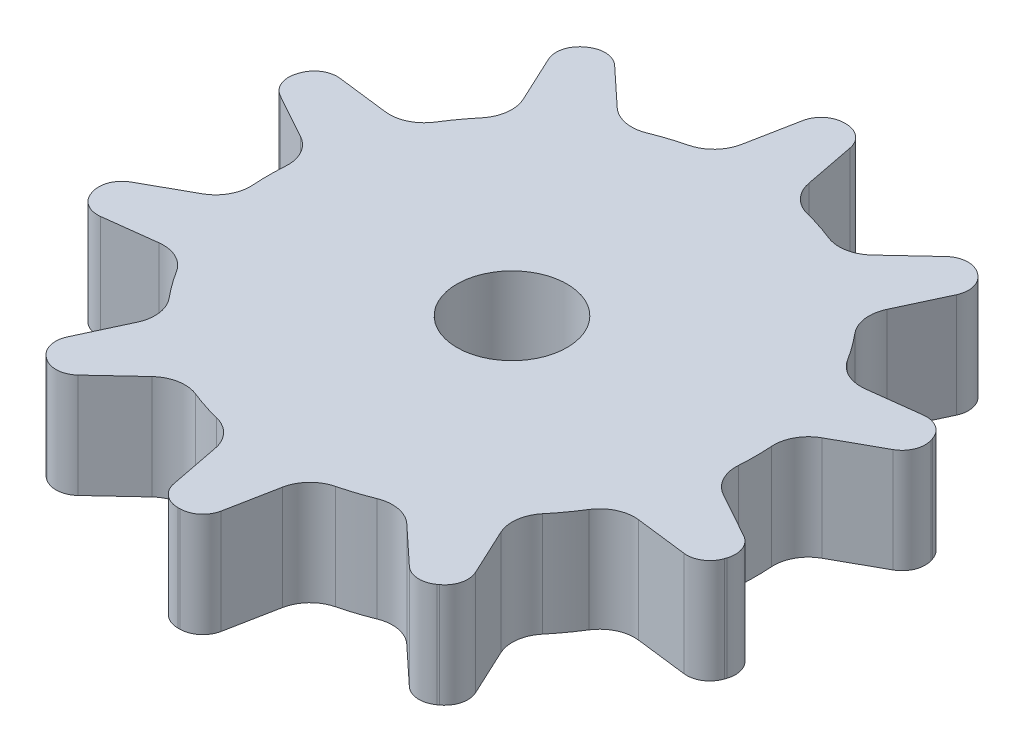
ISO-10303-21;
HEADER;
FILE_DESCRIPTION(('STEP AP214'),'2;1');
FILE_NAME('part.step','',(''),(''),'','','');
FILE_SCHEMA(('AUTOMOTIVE_DESIGN { 1 0 10303 214 1 1 1 1 }'));
ENDSEC;
DATA;
#1=APPLICATION_CONTEXT('core data for automotive mechanical design processes');
#2=APPLICATION_PROTOCOL_DEFINITION('international standard','automotive_design',2000,#1);
#3=PRODUCT_CONTEXT('',#1,'mechanical');
#4=PRODUCT('Part','Part','',(#3));
#5=PRODUCT_RELATED_PRODUCT_CATEGORY('part','',(#4));
#6=PRODUCT_DEFINITION_FORMATION('','',#4);
#7=PRODUCT_DEFINITION_CONTEXT('part definition',#1,'design');
#8=PRODUCT_DEFINITION('design','',#6,#7);
#9=PRODUCT_DEFINITION_SHAPE('','',#8);
#10=(LENGTH_UNIT() NAMED_UNIT(*) SI_UNIT(.MILLI.,.METRE.));
#11=(NAMED_UNIT(*) PLANE_ANGLE_UNIT() SI_UNIT($,.RADIAN.));
#12=(NAMED_UNIT(*) SI_UNIT($,.STERADIAN.) SOLID_ANGLE_UNIT());
#13=UNCERTAINTY_MEASURE_WITH_UNIT(LENGTH_MEASURE(1.E-05),#10,'distance_accuracy_value','');
#14=(GEOMETRIC_REPRESENTATION_CONTEXT(3) GLOBAL_UNCERTAINTY_ASSIGNED_CONTEXT((#13)) GLOBAL_UNIT_ASSIGNED_CONTEXT((#10,
#11,#12)) REPRESENTATION_CONTEXT('',''));
#15=CARTESIAN_POINT('',(0.,0.,0.));
#16=DIRECTION('',(0.,0.,1.));
#17=DIRECTION('',(1.,0.,0.));
#18=AXIS2_PLACEMENT_3D('',#15,#16,#17);
#19=CARTESIAN_POINT('',(0.,9.,-65.));
#20=DIRECTION('',(0.,-1.,0.));
#21=DIRECTION('',(0.,0.,-1.));
#22=AXIS2_PLACEMENT_3D('',#19,#20,#21);
#23=CYLINDRICAL_SURFACE('',#22,28.75);
#24=CARTESIAN_POINT('',(0.,0.,-65.));
#25=DIRECTION('',(0.,1.,0.));
#26=DIRECTION('',(0.,0.,1.));
#27=AXIS2_PLACEMENT_3D('',#24,#25,#26);
#28=CIRCLE('',#27,28.75);
#29=CARTESIAN_POINT('',(-27.3692467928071,0.,-56.1973396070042));
#30=VERTEX_POINT('',#29);
#31=CARTESIAN_POINT('',(-27.3162597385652,0.,-56.0342622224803));
#32=VERTEX_POINT('',#31);
#33=EDGE_CURVE('E1132',#30,#32,#28,.T.);
#34=ORIENTED_EDGE('',*,*,#33,.T.);
#35=DIRECTION('',(0.,-1.,0.));
#36=VECTOR('',#35,1.);
#37=CARTESIAN_POINT('',(-27.3162597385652,9.,-56.0342622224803));
#38=LINE('',#37,#36);
#39=CARTESIAN_POINT('',(-27.3162597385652,9.,-56.0342622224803));
#40=VERTEX_POINT('',#39);
#41=EDGE_CURVE('E1001',#32,#40,#38,.F.);
#42=ORIENTED_EDGE('',*,*,#41,.T.);
#43=CARTESIAN_POINT('',(0.,9.,-65.));
#44=DIRECTION('',(0.,1.,0.));
#45=DIRECTION('',(0.,0.,1.));
#46=AXIS2_PLACEMENT_3D('',#43,#44,#45);
#47=CIRCLE('',#46,28.75);
#48=CARTESIAN_POINT('',(-27.3692467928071,9.,-56.1973396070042));
#49=VERTEX_POINT('',#48);
#50=EDGE_CURVE('E1351',#49,#40,#47,.T.);
#51=ORIENTED_EDGE('',*,*,#50,.F.);
#52=DIRECTION('',(0.,-1.,0.));
#53=VECTOR('',#52,1.);
#54=CARTESIAN_POINT('',(-27.3692467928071,9.,-56.1973396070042));
#55=LINE('',#54,#53);
#56=EDGE_CURVE('E999',#49,#30,#55,.T.);
#57=ORIENTED_EDGE('',*,*,#56,.T.);
#58=EDGE_LOOP('',(#34,#42,#51,#57));
#59=FACE_BOUND('',#58,.T.);
#60=ADVANCED_FACE('F36',(#59),#23,.T.);
#61=CARTESIAN_POINT('',(-16.968111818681,0.,-41.7912585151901));
#62=VERTEX_POINT('',#61);
#63=CARTESIAN_POINT('',(-16.8293899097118,0.,-41.6904711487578));
#64=VERTEX_POINT('',#63);
#65=EDGE_CURVE('E1137',#62,#64,#28,.T.);
#66=ORIENTED_EDGE('',*,*,#65,.T.);
#67=DIRECTION('',(0.,-1.,0.));
#68=VECTOR('',#67,1.);
#69=CARTESIAN_POINT('',(-16.8293899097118,9.,-41.6904711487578));
#70=LINE('',#69,#68);
#71=CARTESIAN_POINT('',(-16.8293899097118,9.,-41.6904711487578));
#72=VERTEX_POINT('',#71);
#73=EDGE_CURVE('E983',#64,#72,#70,.F.);
#74=ORIENTED_EDGE('',*,*,#73,.T.);
#75=CARTESIAN_POINT('',(-16.968111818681,9.,-41.7912585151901));
#76=VERTEX_POINT('',#75);
#77=EDGE_CURVE('E1352',#76,#72,#47,.T.);
#78=ORIENTED_EDGE('',*,*,#77,.F.);
#79=DIRECTION('',(0.,-1.,0.));
#80=VECTOR('',#79,1.);
#81=CARTESIAN_POINT('',(-16.968111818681,9.,-41.7912585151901));
#82=LINE('',#81,#80);
#83=EDGE_CURVE('E981',#76,#62,#82,.T.);
#84=ORIENTED_EDGE('',*,*,#83,.T.);
#85=EDGE_LOOP('',(#66,#74,#78,#84));
#86=FACE_BOUND('',#85,.T.);
#87=ADVANCED_FACE('F1207',(#86),#23,.T.);
#88=CARTESIAN_POINT('',(-27.316259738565,0.,-73.9657377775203));
#89=VERTEX_POINT('',#88);
#90=CARTESIAN_POINT('',(-27.369246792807,0.,-73.8026603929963));
#91=VERTEX_POINT('',#90);
#92=EDGE_CURVE('E1054',#89,#91,#28,.T.);
#93=ORIENTED_EDGE('',*,*,#92,.T.);
#94=DIRECTION('',(0.,-1.,0.));
#95=VECTOR('',#94,1.);
#96=CARTESIAN_POINT('',(-27.369246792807,9.,-73.8026603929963));
#97=LINE('',#96,#95);
#98=CARTESIAN_POINT('',(-27.369246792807,9.,-73.8026603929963));
#99=VERTEX_POINT('',#98);
#100=EDGE_CURVE('E1019',#91,#99,#97,.F.);
#101=ORIENTED_EDGE('',*,*,#100,.T.);
#102=CARTESIAN_POINT('',(-27.316259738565,9.,-73.9657377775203));
#103=VERTEX_POINT('',#102);
#104=EDGE_CURVE('E1196',#103,#99,#47,.T.);
#105=ORIENTED_EDGE('',*,*,#104,.F.);
#106=DIRECTION('',(0.,-1.,0.));
#107=VECTOR('',#106,1.);
#108=CARTESIAN_POINT('',(-27.316259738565,9.,-73.9657377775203));
#109=LINE('',#108,#107);
#110=EDGE_CURVE('E1017',#103,#89,#109,.T.);
#111=ORIENTED_EDGE('',*,*,#110,.T.);
#112=EDGE_LOOP('',(#93,#101,#105,#111));
#113=FACE_BOUND('',#112,.T.);
#114=ADVANCED_FACE('F1212',(#113),#23,.T.);
#115=CARTESIAN_POINT('',(27.316259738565,0.,-56.0342622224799));
#116=VERTEX_POINT('',#115);
#117=CARTESIAN_POINT('',(27.369246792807,0.,-56.1973396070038));
#118=VERTEX_POINT('',#117);
#119=EDGE_CURVE('E1150',#116,#118,#28,.T.);
#120=ORIENTED_EDGE('',*,*,#119,.T.);
#121=DIRECTION('',(0.,-1.,0.));
#122=VECTOR('',#121,1.);
#123=CARTESIAN_POINT('',(27.369246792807,9.,-56.1973396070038));
#124=LINE('',#123,#122);
#125=CARTESIAN_POINT('',(27.369246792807,9.,-56.1973396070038));
#126=VERTEX_POINT('',#125);
#127=EDGE_CURVE('E929',#118,#126,#124,.F.);
#128=ORIENTED_EDGE('',*,*,#127,.T.);
#129=CARTESIAN_POINT('',(27.316259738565,9.,-56.0342622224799));
#130=VERTEX_POINT('',#129);
#131=EDGE_CURVE('E1360',#130,#126,#47,.T.);
#132=ORIENTED_EDGE('',*,*,#131,.F.);
#133=DIRECTION('',(0.,-1.,0.));
#134=VECTOR('',#133,1.);
#135=CARTESIAN_POINT('',(27.316259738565,9.,-56.0342622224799));
#136=LINE('',#135,#134);
#137=EDGE_CURVE('E927',#130,#116,#136,.T.);
#138=ORIENTED_EDGE('',*,*,#137,.T.);
#139=EDGE_LOOP('',(#120,#128,#132,#138));
#140=FACE_BOUND('',#139,.T.);
#141=ADVANCED_FACE('F1394',(#140),#23,.T.);
#142=CARTESIAN_POINT('',(27.3692467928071,0.,-73.802660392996));
#143=VERTEX_POINT('',#142);
#144=CARTESIAN_POINT('',(27.3162597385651,0.,-73.9657377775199));
#145=VERTEX_POINT('',#144);
#146=EDGE_CURVE('E871',#143,#145,#28,.T.);
#147=ORIENTED_EDGE('',*,*,#146,.T.);
#148=DIRECTION('',(0.,-1.,0.));
#149=VECTOR('',#148,1.);
#150=CARTESIAN_POINT('',(27.3162597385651,9.,-73.9657377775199));
#151=LINE('',#150,#149);
#152=CARTESIAN_POINT('',(27.3162597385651,9.,-73.9657377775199));
#153=VERTEX_POINT('',#152);
#154=EDGE_CURVE('E911',#145,#153,#151,.F.);
#155=ORIENTED_EDGE('',*,*,#154,.T.);
#156=CARTESIAN_POINT('',(27.3692467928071,9.,-73.802660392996));
#157=VERTEX_POINT('',#156);
#158=EDGE_CURVE('E865',#157,#153,#47,.T.);
#159=ORIENTED_EDGE('',*,*,#158,.F.);
#160=DIRECTION('',(0.,-1.,0.));
#161=VECTOR('',#160,1.);
#162=CARTESIAN_POINT('',(27.3692467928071,9.,-73.802660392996));
#163=LINE('',#162,#161);
#164=EDGE_CURVE('E909',#157,#143,#163,.T.);
#165=ORIENTED_EDGE('',*,*,#164,.T.);
#166=EDGE_LOOP('',(#147,#155,#159,#165));
#167=FACE_BOUND('',#166,.T.);
#168=ADVANCED_FACE('F1369',(#167),#23,.T.);
#169=CARTESIAN_POINT('',(-0.0857348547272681,0.,-36.2501278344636));
#170=VERTEX_POINT('',#169);
#171=CARTESIAN_POINT('',(0.0857348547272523,0.,-36.2501278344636));
#172=VERTEX_POINT('',#171);
#173=EDGE_CURVE('E1140',#170,#172,#28,.T.);
#174=ORIENTED_EDGE('',*,*,#173,.T.);
#175=DIRECTION('',(0.,-1.,0.));
#176=VECTOR('',#175,1.);
#177=CARTESIAN_POINT('',(0.0857348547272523,9.,-36.2501278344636));
#178=LINE('',#177,#176);
#179=CARTESIAN_POINT('',(0.0857348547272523,9.,-36.2501278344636));
#180=VERTEX_POINT('',#179);
#181=EDGE_CURVE('E965',#172,#180,#178,.F.);
#182=ORIENTED_EDGE('',*,*,#181,.T.);
#183=CARTESIAN_POINT('',(-0.0857348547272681,9.,-36.2501278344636));
#184=VERTEX_POINT('',#183);
#185=EDGE_CURVE('E1354',#184,#180,#47,.T.);
#186=ORIENTED_EDGE('',*,*,#185,.F.);
#187=DIRECTION('',(0.,-1.,0.));
#188=VECTOR('',#187,1.);
#189=CARTESIAN_POINT('',(-0.0857348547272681,9.,-36.2501278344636));
#190=LINE('',#189,#188);
#191=EDGE_CURVE('E963',#184,#170,#190,.T.);
#192=ORIENTED_EDGE('',*,*,#191,.T.);
#193=EDGE_LOOP('',(#174,#182,#186,#192));
#194=FACE_BOUND('',#193,.T.);
#195=ADVANCED_FACE('F1231',(#194),#23,.T.);
#196=CARTESIAN_POINT('',(16.8293899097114,0.,-41.6904711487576));
#197=VERTEX_POINT('',#196);
#198=CARTESIAN_POINT('',(16.9681118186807,0.,-41.7912585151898));
#199=VERTEX_POINT('',#198);
#200=EDGE_CURVE('E1145',#197,#199,#28,.T.);
#201=ORIENTED_EDGE('',*,*,#200,.T.);
#202=DIRECTION('',(0.,-1.,0.));
#203=VECTOR('',#202,1.);
#204=CARTESIAN_POINT('',(16.9681118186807,9.,-41.7912585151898));
#205=LINE('',#204,#203);
#206=CARTESIAN_POINT('',(16.9681118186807,9.,-41.7912585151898));
#207=VERTEX_POINT('',#206);
#208=EDGE_CURVE('E947',#199,#207,#205,.F.);
#209=ORIENTED_EDGE('',*,*,#208,.T.);
#210=CARTESIAN_POINT('',(16.8293899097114,9.,-41.6904711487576));
#211=VERTEX_POINT('',#210);
#212=EDGE_CURVE('E1357',#211,#207,#47,.T.);
#213=ORIENTED_EDGE('',*,*,#212,.F.);
#214=DIRECTION('',(0.,-1.,0.));
#215=VECTOR('',#214,1.);
#216=CARTESIAN_POINT('',(16.8293899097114,9.,-41.6904711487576));
#217=LINE('',#216,#215);
#218=EDGE_CURVE('E945',#211,#197,#217,.T.);
#219=ORIENTED_EDGE('',*,*,#218,.T.);
#220=EDGE_LOOP('',(#201,#209,#213,#219));
#221=FACE_BOUND('',#220,.T.);
#222=ADVANCED_FACE('F1226',(#221),#23,.T.);
#223=CARTESIAN_POINT('',(16.9681118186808,0.,-88.2087414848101));
#224=VERTEX_POINT('',#223);
#225=CARTESIAN_POINT('',(16.8293899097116,0.,-88.3095288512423));
#226=VERTEX_POINT('',#225);
#227=EDGE_CURVE('E840',#224,#226,#28,.T.);
#228=ORIENTED_EDGE('',*,*,#227,.T.);
#229=DIRECTION('',(0.,-1.,0.));
#230=VECTOR('',#229,1.);
#231=CARTESIAN_POINT('',(16.8293899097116,9.,-88.3095288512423));
#232=LINE('',#231,#230);
#233=CARTESIAN_POINT('',(16.8293899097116,9.,-88.3095288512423));
#234=VERTEX_POINT('',#233);
#235=EDGE_CURVE('E893',#226,#234,#232,.F.);
#236=ORIENTED_EDGE('',*,*,#235,.T.);
#237=CARTESIAN_POINT('',(16.9681118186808,9.,-88.2087414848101));
#238=VERTEX_POINT('',#237);
#239=EDGE_CURVE('E862',#238,#234,#47,.T.);
#240=ORIENTED_EDGE('',*,*,#239,.F.);
#241=DIRECTION('',(0.,-1.,0.));
#242=VECTOR('',#241,1.);
#243=CARTESIAN_POINT('',(16.9681118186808,9.,-88.2087414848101));
#244=LINE('',#243,#242);
#245=EDGE_CURVE('E891',#238,#224,#244,.T.);
#246=ORIENTED_EDGE('',*,*,#245,.T.);
#247=EDGE_LOOP('',(#228,#236,#240,#246));
#248=FACE_BOUND('',#247,.T.);
#249=ADVANCED_FACE('F1222',(#248),#23,.T.);
#250=CARTESIAN_POINT('',(0.0857348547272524,0.,-93.7498721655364));
#251=VERTEX_POINT('',#250);
#252=CARTESIAN_POINT('',(-0.0857348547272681,0.,-93.7498721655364));
#253=VERTEX_POINT('',#252);
#254=EDGE_CURVE('E866',#251,#253,#28,.T.);
#255=ORIENTED_EDGE('',*,*,#254,.T.);
#256=DIRECTION('',(0.,-1.,0.));
#257=VECTOR('',#256,1.);
#258=CARTESIAN_POINT('',(-0.0857348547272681,9.,-93.7498721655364));
#259=LINE('',#258,#257);
#260=CARTESIAN_POINT('',(-0.0857348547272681,9.,-93.7498721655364));
#261=VERTEX_POINT('',#260);
#262=EDGE_CURVE('E875',#253,#261,#259,.F.);
#263=ORIENTED_EDGE('',*,*,#262,.T.);
#264=CARTESIAN_POINT('',(0.0857348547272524,9.,-93.7498721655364));
#265=VERTEX_POINT('',#264);
#266=EDGE_CURVE('E868',#265,#261,#47,.T.);
#267=ORIENTED_EDGE('',*,*,#266,.F.);
#268=DIRECTION('',(0.,-1.,0.));
#269=VECTOR('',#268,1.);
#270=CARTESIAN_POINT('',(0.0857348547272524,9.,-93.7498721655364));
#271=LINE('',#270,#269);
#272=EDGE_CURVE('E873',#265,#251,#271,.T.);
#273=ORIENTED_EDGE('',*,*,#272,.T.);
#274=EDGE_LOOP('',(#255,#263,#267,#273));
#275=FACE_BOUND('',#274,.T.);
#276=ADVANCED_FACE('F1166',(#275),#23,.T.);
#277=CARTESIAN_POINT('',(-16.8293899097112,0.,-88.3095288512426));
#278=VERTEX_POINT('',#277);
#279=CARTESIAN_POINT('',(-16.9681118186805,0.,-88.2087414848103));
#280=VERTEX_POINT('',#279);
#281=EDGE_CURVE('E872',#278,#280,#28,.T.);
#282=ORIENTED_EDGE('',*,*,#281,.T.);
#283=DIRECTION('',(0.,-1.,0.));
#284=VECTOR('',#283,1.);
#285=CARTESIAN_POINT('',(-16.9681118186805,9.,-88.2087414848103));
#286=LINE('',#285,#284);
#287=CARTESIAN_POINT('',(-16.9681118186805,9.,-88.2087414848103));
#288=VERTEX_POINT('',#287);
#289=EDGE_CURVE('E1037',#280,#288,#286,.F.);
#290=ORIENTED_EDGE('',*,*,#289,.T.);
#291=CARTESIAN_POINT('',(-16.8293899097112,9.,-88.3095288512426));
#292=VERTEX_POINT('',#291);
#293=EDGE_CURVE('E867',#292,#288,#47,.T.);
#294=ORIENTED_EDGE('',*,*,#293,.F.);
#295=DIRECTION('',(0.,-1.,0.));
#296=VECTOR('',#295,1.);
#297=CARTESIAN_POINT('',(-16.8293899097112,9.,-88.3095288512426));
#298=LINE('',#297,#296);
#299=EDGE_CURVE('E1035',#292,#278,#298,.T.);
#300=ORIENTED_EDGE('',*,*,#299,.T.);
#301=EDGE_LOOP('',(#282,#290,#294,#300));
#302=FACE_BOUND('',#301,.T.);
#303=ADVANCED_FACE('F1050',(#302),#23,.T.);
#304=CARTESIAN_POINT('',(0.,9.,0.));
#305=DIRECTION('',(0.,1.,0.));
#306=DIRECTION('',(0.,0.,1.));
#307=AXIS2_PLACEMENT_3D('',#304,#305,#306);
#308=PLANE('',#307);
#309=CARTESIAN_POINT('',(0.,9.,-65.));
#310=DIRECTION('',(0.,1.,0.));
#311=DIRECTION('',(0.,0.,1.));
#312=AXIS2_PLACEMENT_3D('',#309,#310,#311);
#313=CIRCLE('',#312,4.75);
#314=CARTESIAN_POINT('',(0.,9.,-60.25));
#315=VERTEX_POINT('',#314);
#316=EDGE_CURVE('E1568',#315,#315,#313,.T.);
#317=ORIENTED_EDGE('',*,*,#316,.F.);
#318=EDGE_LOOP('',(#317));
#319=FACE_BOUND('',#318,.T.);
#320=ORIENTED_EDGE('',*,*,#293,.T.);
#321=CARTESIAN_POINT('',(-15.787721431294,9.,-86.5942203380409));
#322=DIRECTION('',(0.,1.,0.));
#323=DIRECTION('',(0.,0.,1.));
#324=AXIS2_PLACEMENT_3D('',#321,#322,#323);
#325=CIRCLE('',#324,2.);
#326=CARTESIAN_POINT('',(-17.6003370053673,9.,-85.7489838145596));
#327=VERTEX_POINT('',#326);
#328=EDGE_CURVE('E1042',#288,#327,#325,.T.);
#329=ORIENTED_EDGE('',*,*,#328,.T.);
#330=DIRECTION('',(-0.42261826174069,0.,-0.906307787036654));
#331=VECTOR('',#330,1.);
#332=CARTESIAN_POINT('',(-18.274492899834,9.,-87.1947157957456));
#333=LINE('',#332,#331);
#334=CARTESIAN_POINT('',(-15.6941997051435,9.,-81.6612591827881));
#335=VERTEX_POINT('',#334);
#336=EDGE_CURVE('E553',#335,#327,#333,.T.);
#337=ORIENTED_EDGE('',*,*,#336,.F.);
#338=CARTESIAN_POINT('',(-18.4131230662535,9.,-80.393404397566));
#339=DIRECTION('',(0.,1.,0.));
#340=DIRECTION('',(-0.587785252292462,0.,-0.809016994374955));
#341=AXIS2_PLACEMENT_3D('',#338,#339,#340);
#342=CIRCLE('',#341,3.);
#343=CARTESIAN_POINT('',(-16.1114826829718,9.,-78.4692288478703));
#344=VERTEX_POINT('',#343);
#345=EDGE_CURVE('E1060',#344,#335,#342,.T.);
#346=ORIENTED_EDGE('',*,*,#345,.F.);
#347=CARTESIAN_POINT('',(0.,9.,-65.));
#348=DIRECTION('',(0.,-1.,0.));
#349=DIRECTION('',(0.95105651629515,0.,0.309016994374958));
#350=AXIS2_PLACEMENT_3D('',#347,#348,#349);
#351=CIRCLE('',#350,21.);
#352=CARTESIAN_POINT('',(-17.7887198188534,9.,-76.1607099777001));
#353=VERTEX_POINT('',#352);
#354=EDGE_CURVE('E542',#353,#344,#351,.T.);
#355=ORIENTED_EDGE('',*,*,#354,.F.);
#356=CARTESIAN_POINT('',(-20.329965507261,9.,-77.7550971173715));
#357=DIRECTION('',(0.,1.,0.));
#358=DIRECTION('',(0.95105651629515,0.,0.309016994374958));
#359=AXIS2_PLACEMENT_3D('',#356,#357,#358);
#360=CIRCLE('',#359,3.);
#361=CARTESIAN_POINT('',(-20.6955735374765,9.,-74.7774586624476));
#362=VERTEX_POINT('',#361);
#363=EDGE_CURVE('E566',#362,#353,#360,.T.);
#364=ORIENTED_EDGE('',*,*,#363,.F.);
#365=DIRECTION('',(0.992546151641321,0.,0.121869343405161));
#366=VECTOR('',#365,1.);
#367=CARTESIAN_POINT('',(-26.7555579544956,9.,-75.5215311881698));
#368=LINE('',#367,#366);
#369=CARTESIAN_POINT('',(-25.172259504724,9.,-75.3271265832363));
#370=VERTEX_POINT('',#369);
#371=EDGE_CURVE('E562',#370,#362,#368,.T.);
#372=ORIENTED_EDGE('',*,*,#371,.F.);
#373=CARTESIAN_POINT('',(-25.4159981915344,9.,-73.3420342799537));
#374=DIRECTION('',(0.,1.,0.));
#375=DIRECTION('',(0.,0.,1.));
#376=AXIS2_PLACEMENT_3D('',#373,#374,#375);
#377=CIRCLE('',#376,2.);
#378=EDGE_CURVE('E1022',#370,#103,#377,.T.);
#379=ORIENTED_EDGE('',*,*,#378,.T.);
#380=ORIENTED_EDGE('',*,*,#104,.T.);
#381=CARTESIAN_POINT('',(-25.4652991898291,9.,-73.1903014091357));
#382=DIRECTION('',(0.,1.,0.));
#383=DIRECTION('',(0.,0.,1.));
#384=AXIS2_PLACEMENT_3D('',#381,#382,#383);
#385=CIRCLE('',#384,2.);
#386=CARTESIAN_POINT('',(-26.4349184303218,9.,-71.441061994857));
#387=VERTEX_POINT('',#386);
#388=EDGE_CURVE('E1024',#99,#387,#385,.T.);
#389=ORIENTED_EDGE('',*,*,#388,.T.);
#390=DIRECTION('',(-0.874619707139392,0.,-0.484809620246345));
#391=VECTOR('',#390,1.);
#392=CARTESIAN_POINT('',(-27.8301019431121,9.,-72.2144248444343));
#393=LINE('',#392,#391);
#394=CARTESIAN_POINT('',(-22.4901167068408,9.,-69.2544226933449));
#395=VERTEX_POINT('',#394);
#396=EDGE_CURVE('E1072',#395,#387,#393,.T.);
#397=ORIENTED_EDGE('',*,*,#396,.F.);
#398=CARTESIAN_POINT('',(-23.9445455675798,9.,-66.6305635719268));
#399=DIRECTION('',(0.,1.,0.));
#400=DIRECTION('',(-0.95105651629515,0.,-0.309016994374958));
#401=AXIS2_PLACEMENT_3D('',#398,#399,#400);
#402=CIRCLE('',#401,3.);
#403=CARTESIAN_POINT('',(-20.9514773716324,9.,-66.4267431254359));
#404=VERTEX_POINT('',#403);
#405=EDGE_CURVE('E1076',#404,#395,#402,.T.);
#406=ORIENTED_EDGE('',*,*,#405,.F.);
#407=CARTESIAN_POINT('',(0.,9.,-65.));
#408=DIRECTION('',(0.,-1.,0.));
#409=DIRECTION('',(0.951056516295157,0.,-0.309016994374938));
#410=AXIS2_PLACEMENT_3D('',#407,#408,#409);
#411=CIRCLE('',#410,21.);
#412=CARTESIAN_POINT('',(-20.9514773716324,9.,-63.5732568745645));
#413=VERTEX_POINT('',#412);
#414=EDGE_CURVE('E609',#413,#404,#411,.T.);
#415=ORIENTED_EDGE('',*,*,#414,.F.);
#416=CARTESIAN_POINT('',(-23.9445455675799,9.,-63.3694364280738));
#417=DIRECTION('',(0.,1.,0.));
#418=DIRECTION('',(0.951056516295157,0.,-0.309016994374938));
#419=AXIS2_PLACEMENT_3D('',#416,#417,#418);
#420=CIRCLE('',#419,3.);
#421=CARTESIAN_POINT('',(-22.4901167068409,9.,-60.7455773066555));
#422=VERTEX_POINT('',#421);
#423=EDGE_CURVE('E606',#422,#413,#420,.T.);
#424=ORIENTED_EDGE('',*,*,#423,.F.);
#425=DIRECTION('',(0.874619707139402,0.,-0.484809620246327));
#426=VECTOR('',#425,1.);
#427=CARTESIAN_POINT('',(-27.8301019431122,9.,-57.7855751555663));
#428=LINE('',#427,#426);
#429=CARTESIAN_POINT('',(-26.4349184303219,9.,-58.5589380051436));
#430=VERTEX_POINT('',#429);
#431=EDGE_CURVE('E600',#430,#422,#428,.T.);
#432=ORIENTED_EDGE('',*,*,#431,.F.);
#433=CARTESIAN_POINT('',(-25.4652991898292,9.,-56.8096985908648));
#434=DIRECTION('',(0.,1.,0.));
#435=DIRECTION('',(0.,0.,1.));
#436=AXIS2_PLACEMENT_3D('',#433,#434,#435);
#437=CIRCLE('',#436,2.);
#438=EDGE_CURVE('E1004',#430,#49,#437,.T.);
#439=ORIENTED_EDGE('',*,*,#438,.T.);
#440=ORIENTED_EDGE('',*,*,#50,.T.);
#441=CARTESIAN_POINT('',(-25.4159981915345,9.,-56.6579657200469));
#442=DIRECTION('',(0.,1.,0.));
#443=DIRECTION('',(0.,0.,1.));
#444=AXIS2_PLACEMENT_3D('',#441,#442,#443);
#445=CIRCLE('',#444,2.);
#446=CARTESIAN_POINT('',(-25.1722595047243,9.,-54.6728734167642));
#447=VERTEX_POINT('',#446);
#448=EDGE_CURVE('E1006',#40,#447,#445,.T.);
#449=ORIENTED_EDGE('',*,*,#448,.T.);
#450=DIRECTION('',(-0.992546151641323,0.,0.121869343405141));
#451=VECTOR('',#450,1.);
#452=CARTESIAN_POINT('',(-26.7555579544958,9.,-54.4784688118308));
#453=LINE('',#452,#451);
#454=CARTESIAN_POINT('',(-20.6955735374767,9.,-55.2225413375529));
#455=VERTEX_POINT('',#454);
#456=EDGE_CURVE('E1103',#455,#447,#453,.T.);
#457=ORIENTED_EDGE('',*,*,#456,.F.);
#458=CARTESIAN_POINT('',(-20.3299655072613,9.,-52.2449028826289));
#459=DIRECTION('',(0.,1.,0.));
#460=DIRECTION('',(-0.951056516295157,0.,0.309016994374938));
#461=AXIS2_PLACEMENT_3D('',#458,#459,#460);
#462=CIRCLE('',#461,3.);
#463=CARTESIAN_POINT('',(-17.7887198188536,9.,-53.8392900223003));
#464=VERTEX_POINT('',#463);
#465=EDGE_CURVE('E575',#464,#455,#462,.T.);
#466=ORIENTED_EDGE('',*,*,#465,.F.);
#467=CARTESIAN_POINT('',(0.,9.,-65.));
#468=DIRECTION('',(0.,-1.,0.));
#469=DIRECTION('',(0.58778525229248,0.,-0.809016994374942));
#470=AXIS2_PLACEMENT_3D('',#467,#468,#469);
#471=CIRCLE('',#470,21.);
#472=CARTESIAN_POINT('',(-16.1114826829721,9.,-51.5307711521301));
#473=VERTEX_POINT('',#472);
#474=EDGE_CURVE('E647',#473,#464,#471,.T.);
#475=ORIENTED_EDGE('',*,*,#474,.F.);
#476=CARTESIAN_POINT('',(-18.4131230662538,9.,-49.6065956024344));
#477=DIRECTION('',(0.,1.,0.));
#478=DIRECTION('',(0.58778525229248,0.,-0.809016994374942));
#479=AXIS2_PLACEMENT_3D('',#476,#477,#478);
#480=CIRCLE('',#479,3.);
#481=CARTESIAN_POINT('',(-15.6941997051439,9.,-48.3387408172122));
#482=VERTEX_POINT('',#481);
#483=EDGE_CURVE('E593',#482,#473,#480,.T.);
#484=ORIENTED_EDGE('',*,*,#483,.F.);
#485=DIRECTION('',(0.42261826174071,0.,-0.906307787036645));
#486=VECTOR('',#485,1.);
#487=CARTESIAN_POINT('',(-18.2744928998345,9.,-42.8052842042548));
#488=LINE('',#487,#486);
#489=CARTESIAN_POINT('',(-17.6003370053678,9.,-44.2510161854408));
#490=VERTEX_POINT('',#489);
#491=EDGE_CURVE('E639',#490,#482,#488,.T.);
#492=ORIENTED_EDGE('',*,*,#491,.F.);
#493=CARTESIAN_POINT('',(-15.7877214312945,9.,-43.4057796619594));
#494=DIRECTION('',(0.,1.,0.));
#495=DIRECTION('',(0.,0.,1.));
#496=AXIS2_PLACEMENT_3D('',#493,#494,#495);
#497=CIRCLE('',#496,2.);
#498=EDGE_CURVE('E986',#490,#76,#497,.T.);
#499=ORIENTED_EDGE('',*,*,#498,.T.);
#500=ORIENTED_EDGE('',*,*,#77,.T.);
#501=CARTESIAN_POINT('',(-15.6586497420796,9.,-43.3120035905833));
#502=DIRECTION('',(0.,1.,0.));
#503=DIRECTION('',(0.,0.,1.));
#504=AXIS2_PLACEMENT_3D('',#501,#502,#503);
#505=CIRCLE('',#504,2.);
#506=CARTESIAN_POINT('',(-14.2946530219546,9.,-41.849296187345));
#507=VERTEX_POINT('',#506);
#508=EDGE_CURVE('E988',#72,#507,#505,.T.);
#509=ORIENTED_EDGE('',*,*,#508,.T.);
#510=DIRECTION('',(-0.731353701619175,0.,0.681998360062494));
#511=VECTOR('',#510,1.);
#512=CARTESIAN_POINT('',(-15.4613002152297,9.,-40.7613800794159));
#513=LINE('',#512,#511);
#514=CARTESIAN_POINT('',(-10.9960246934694,9.,-44.9253168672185));
#515=VERTEX_POINT('',#514);
#516=EDGE_CURVE('E581',#515,#507,#513,.T.);
#517=ORIENTED_EDGE('',*,*,#516,.F.);
#518=CARTESIAN_POINT('',(-8.95002961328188,9.,-42.731255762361));
#519=DIRECTION('',(0.,1.,0.));
#520=DIRECTION('',(-0.58778525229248,0.,0.809016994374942));
#521=AXIS2_PLACEMENT_3D('',#518,#519,#520);
#522=CIRCLE('',#521,3.);
#523=CARTESIAN_POINT('',(-7.83127591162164,9.,-45.5148487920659));
#524=VERTEX_POINT('',#523);
#525=EDGE_CURVE('E585',#524,#515,#522,.T.);
#526=ORIENTED_EDGE('',*,*,#525,.F.);
#527=CARTESIAN_POINT('',(0.,9.,-65.));
#528=DIRECTION('',(0.,-1.,0.));
#529=DIRECTION('',(0.,0.,-1.));
#530=AXIS2_PLACEMENT_3D('',#527,#528,#529);
#531=CIRCLE('',#530,21.);
#532=CARTESIAN_POINT('',(-5.11744921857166,9.,-44.6330730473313));
#533=VERTEX_POINT('',#532);
#534=EDGE_CURVE('E684',#533,#524,#531,.T.);
#535=ORIENTED_EDGE('',*,*,#534,.F.);
#536=CARTESIAN_POINT('',(-5.84851339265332,9.,-41.723512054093));
#537=DIRECTION('',(0.,1.,0.));
#538=DIRECTION('',(0.,0.,-1.));
#539=AXIS2_PLACEMENT_3D('',#536,#537,#538);
#540=CIRCLE('',#539,3.);
#541=CARTESIAN_POINT('',(-2.90363184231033,9.,-42.2959390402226));
#542=VERTEX_POINT('',#541);
#543=EDGE_CURVE('E632',#542,#533,#540,.T.);
#544=ORIENTED_EDGE('',*,*,#543,.F.);
#545=DIRECTION('',(-0.190808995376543,0.,-0.981627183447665));
#546=VECTOR('',#545,1.);
#547=CARTESIAN_POINT('',(-1.73864869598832,9.,-36.3026203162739));
#548=LINE('',#547,#546);
#549=CARTESIAN_POINT('',(-2.04302505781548,9.,-37.8685009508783));
#550=VERTEX_POINT('',#549);
#551=EDGE_CURVE('E676',#550,#542,#548,.T.);
#552=ORIENTED_EDGE('',*,*,#551,.F.);
#553=CARTESIAN_POINT('',(-0.0797706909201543,9.,-38.2501189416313));
#554=DIRECTION('',(0.,1.,0.));
#555=DIRECTION('',(0.,0.,1.));
#556=AXIS2_PLACEMENT_3D('',#553,#554,#555);
#557=CIRCLE('',#556,2.);
#558=EDGE_CURVE('E968',#550,#184,#557,.T.);
#559=ORIENTED_EDGE('',*,*,#558,.T.);
#560=ORIENTED_EDGE('',*,*,#185,.T.);
#561=CARTESIAN_POINT('',(0.0797706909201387,9.,-38.2501189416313));
#562=DIRECTION('',(0.,1.,0.));
#563=DIRECTION('',(0.,0.,1.));
#564=AXIS2_PLACEMENT_3D('',#561,#562,#563);
#565=CIRCLE('',#564,2.);
#566=CARTESIAN_POINT('',(2.04302505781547,9.,-37.8685009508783));
#567=VERTEX_POINT('',#566);
#568=EDGE_CURVE('E970',#180,#567,#565,.T.);
#569=ORIENTED_EDGE('',*,*,#568,.T.);
#570=DIRECTION('',(-0.190808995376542,0.,0.981627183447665));
#571=VECTOR('',#570,1.);
#572=CARTESIAN_POINT('',(1.7386486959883,9.,-36.3026203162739));
#573=LINE('',#572,#571);
#574=CARTESIAN_POINT('',(2.90363184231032,9.,-42.2959390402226));
#575=VERTEX_POINT('',#574);
#576=EDGE_CURVE('E620',#575,#567,#573,.T.);
#577=ORIENTED_EDGE('',*,*,#576,.F.);
#578=CARTESIAN_POINT('',(5.84851339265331,9.,-41.723512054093));
#579=DIRECTION('',(0.,1.,0.));
#580=DIRECTION('',(0.,0.,1.));
#581=AXIS2_PLACEMENT_3D('',#578,#579,#580);
#582=CIRCLE('',#581,3.);
#583=CARTESIAN_POINT('',(5.11744921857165,9.,-44.6330730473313));
#584=VERTEX_POINT('',#583);
#585=EDGE_CURVE('E624',#584,#575,#582,.T.);
#586=ORIENTED_EDGE('',*,*,#585,.F.);
#587=CARTESIAN_POINT('',(0.,9.,-65.));
#588=DIRECTION('',(0.,-1.,0.));
#589=DIRECTION('',(-0.587785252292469,0.,-0.809016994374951));
#590=AXIS2_PLACEMENT_3D('',#587,#588,#589);
#591=CIRCLE('',#590,21.);
#592=CARTESIAN_POINT('',(7.83127591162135,9.,-45.5148487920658));
#593=VERTEX_POINT('',#592);
#594=EDGE_CURVE('E721',#593,#584,#591,.T.);
#595=ORIENTED_EDGE('',*,*,#594,.F.);
#596=CARTESIAN_POINT('',(8.95002961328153,9.,-42.7312557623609));
#597=DIRECTION('',(0.,1.,0.));
#598=DIRECTION('',(-0.587785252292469,0.,-0.809016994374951));
#599=AXIS2_PLACEMENT_3D('',#596,#597,#598);
#600=CIRCLE('',#599,3.);
#601=CARTESIAN_POINT('',(10.996024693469,9.,-44.9253168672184));
#602=VERTEX_POINT('',#601);
#603=EDGE_CURVE('E669',#602,#593,#600,.T.);
#604=ORIENTED_EDGE('',*,*,#603,.F.);
#605=DIRECTION('',(-0.731353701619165,0.,-0.681998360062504));
#606=VECTOR('',#605,1.);
#607=CARTESIAN_POINT('',(15.4613002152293,9.,-40.7613800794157));
#608=LINE('',#607,#606);
#609=CARTESIAN_POINT('',(14.2946530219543,9.,-41.8492961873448));
#610=VERTEX_POINT('',#609);
#611=EDGE_CURVE('E713',#610,#602,#608,.T.);
#612=ORIENTED_EDGE('',*,*,#611,.F.);
#613=CARTESIAN_POINT('',(15.6586497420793,9.,-43.3120035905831));
#614=DIRECTION('',(0.,1.,0.));
#615=DIRECTION('',(0.,0.,1.));
#616=AXIS2_PLACEMENT_3D('',#613,#614,#615);
#617=CIRCLE('',#616,2.);
#618=EDGE_CURVE('E950',#610,#211,#617,.T.);
#619=ORIENTED_EDGE('',*,*,#618,.T.);
#620=ORIENTED_EDGE('',*,*,#212,.T.);
#621=CARTESIAN_POINT('',(15.7877214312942,9.,-43.4057796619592));
#622=DIRECTION('',(0.,1.,0.));
#623=DIRECTION('',(0.,0.,1.));
#624=AXIS2_PLACEMENT_3D('',#621,#622,#623);
#625=CIRCLE('',#624,2.);
#626=CARTESIAN_POINT('',(17.6003370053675,9.,-44.2510161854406));
#627=VERTEX_POINT('',#626);
#628=EDGE_CURVE('E952',#207,#627,#625,.T.);
#629=ORIENTED_EDGE('',*,*,#628,.T.);
#630=DIRECTION('',(0.422618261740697,0.,0.906307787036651));
#631=VECTOR('',#630,1.);
#632=CARTESIAN_POINT('',(18.2744928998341,9.,-42.8052842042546));
#633=LINE('',#632,#631);
#634=CARTESIAN_POINT('',(15.6941997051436,9.,-48.338740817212));
#635=VERTEX_POINT('',#634);
#636=EDGE_CURVE('E657',#635,#627,#633,.T.);
#637=ORIENTED_EDGE('',*,*,#636,.F.);
#638=CARTESIAN_POINT('',(18.4131230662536,9.,-49.6065956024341));
#639=DIRECTION('',(0.,1.,0.));
#640=DIRECTION('',(0.587785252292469,0.,0.809016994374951));
#641=AXIS2_PLACEMENT_3D('',#638,#639,#640);
#642=CIRCLE('',#641,3.);
#643=CARTESIAN_POINT('',(16.1114826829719,9.,-51.5307711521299));
#644=VERTEX_POINT('',#643);
#645=EDGE_CURVE('E661',#644,#635,#642,.T.);
#646=ORIENTED_EDGE('',*,*,#645,.F.);
#647=CARTESIAN_POINT('',(0.,9.,-65.));
#648=DIRECTION('',(0.,-1.,0.));
#649=DIRECTION('',(-0.951056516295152,0.,-0.309016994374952));
#650=AXIS2_PLACEMENT_3D('',#647,#648,#649);
#651=CIRCLE('',#650,21.);
#652=CARTESIAN_POINT('',(17.7887198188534,9.,-53.8392900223));
#653=VERTEX_POINT('',#652);
#654=EDGE_CURVE('E758',#653,#644,#651,.T.);
#655=ORIENTED_EDGE('',*,*,#654,.F.);
#656=CARTESIAN_POINT('',(20.3299655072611,9.,-52.2449028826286));
#657=DIRECTION('',(0.,1.,0.));
#658=DIRECTION('',(-0.951056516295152,0.,-0.309016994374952));
#659=AXIS2_PLACEMENT_3D('',#656,#657,#658);
#660=CIRCLE('',#659,3.);
#661=CARTESIAN_POINT('',(20.6955735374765,9.,-55.2225413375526));
#662=VERTEX_POINT('',#661);
#663=EDGE_CURVE('E706',#662,#653,#660,.T.);
#664=ORIENTED_EDGE('',*,*,#663,.F.);
#665=DIRECTION('',(-0.992546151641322,0.,-0.121869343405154));
#666=VECTOR('',#665,1.);
#667=CARTESIAN_POINT('',(26.7555579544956,9.,-54.4784688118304));
#668=LINE('',#667,#666);
#669=CARTESIAN_POINT('',(25.1722595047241,9.,-54.6728734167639));
#670=VERTEX_POINT('',#669);
#671=EDGE_CURVE('E750',#670,#662,#668,.T.);
#672=ORIENTED_EDGE('',*,*,#671,.F.);
#673=CARTESIAN_POINT('',(25.4159981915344,9.,-56.6579657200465));
#674=DIRECTION('',(0.,1.,0.));
#675=DIRECTION('',(0.,0.,1.));
#676=AXIS2_PLACEMENT_3D('',#673,#674,#675);
#677=CIRCLE('',#676,2.);
#678=EDGE_CURVE('E932',#670,#130,#677,.T.);
#679=ORIENTED_EDGE('',*,*,#678,.T.);
#680=ORIENTED_EDGE('',*,*,#131,.T.);
#681=CARTESIAN_POINT('',(25.4652991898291,9.,-56.8096985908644));
#682=DIRECTION('',(0.,1.,0.));
#683=DIRECTION('',(0.,0.,1.));
#684=AXIS2_PLACEMENT_3D('',#681,#682,#683);
#685=CIRCLE('',#684,2.);
#686=CARTESIAN_POINT('',(26.4349184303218,9.,-58.5589380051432));
#687=VERTEX_POINT('',#686);
#688=EDGE_CURVE('E934',#126,#687,#685,.T.);
#689=ORIENTED_EDGE('',*,*,#688,.T.);
#690=DIRECTION('',(0.874619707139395,0.,0.484809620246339));
#691=VECTOR('',#690,1.);
#692=CARTESIAN_POINT('',(27.8301019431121,9.,-57.7855751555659));
#693=LINE('',#692,#691);
#694=CARTESIAN_POINT('',(22.4901167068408,9.,-60.7455773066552));
#695=VERTEX_POINT('',#694);
#696=EDGE_CURVE('E694',#695,#687,#693,.T.);
#697=ORIENTED_EDGE('',*,*,#696,.F.);
#698=CARTESIAN_POINT('',(23.9445455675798,9.,-63.3694364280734));
#699=DIRECTION('',(0.,1.,0.));
#700=DIRECTION('',(0.951056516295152,0.,0.309016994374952));
#701=AXIS2_PLACEMENT_3D('',#698,#699,#700);
#702=CIRCLE('',#701,3.);
#703=CARTESIAN_POINT('',(20.9514773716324,9.,-63.5732568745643));
#704=VERTEX_POINT('',#703);
#705=EDGE_CURVE('E698',#704,#695,#702,.T.);
#706=ORIENTED_EDGE('',*,*,#705,.F.);
#707=CARTESIAN_POINT('',(0.,9.,-65.));
#708=DIRECTION('',(0.,-1.,0.));
#709=DIRECTION('',(-0.951056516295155,0.,0.309016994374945));
#710=AXIS2_PLACEMENT_3D('',#707,#708,#709);
#711=CIRCLE('',#710,21.);
#712=CARTESIAN_POINT('',(20.9514773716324,9.,-66.4267431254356));
#713=VERTEX_POINT('',#712);
#714=EDGE_CURVE('E795',#713,#704,#711,.T.);
#715=ORIENTED_EDGE('',*,*,#714,.F.);
#716=CARTESIAN_POINT('',(23.9445455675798,9.,-66.6305635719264));
#717=DIRECTION('',(0.,1.,0.));
#718=DIRECTION('',(-0.951056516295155,0.,0.309016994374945));
#719=AXIS2_PLACEMENT_3D('',#716,#717,#718);
#720=CIRCLE('',#719,3.);
#721=CARTESIAN_POINT('',(22.4901167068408,9.,-69.2544226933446));
#722=VERTEX_POINT('',#721);
#723=EDGE_CURVE('E743',#722,#713,#720,.T.);
#724=ORIENTED_EDGE('',*,*,#723,.F.);
#725=DIRECTION('',(-0.874619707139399,0.,0.484809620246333));
#726=VECTOR('',#725,1.);
#727=CARTESIAN_POINT('',(27.8301019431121,9.,-72.2144248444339));
#728=LINE('',#727,#726);
#729=CARTESIAN_POINT('',(26.4349184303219,9.,-71.4410619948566));
#730=VERTEX_POINT('',#729);
#731=EDGE_CURVE('E787',#730,#722,#728,.T.);
#732=ORIENTED_EDGE('',*,*,#731,.F.);
#733=CARTESIAN_POINT('',(25.4652991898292,9.,-73.1903014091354));
#734=DIRECTION('',(0.,1.,0.));
#735=DIRECTION('',(0.,0.,1.));
#736=AXIS2_PLACEMENT_3D('',#733,#734,#735);
#737=CIRCLE('',#736,2.);
#738=EDGE_CURVE('E914',#730,#157,#737,.T.);
#739=ORIENTED_EDGE('',*,*,#738,.T.);
#740=ORIENTED_EDGE('',*,*,#158,.T.);
#741=CARTESIAN_POINT('',(25.4159981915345,9.,-73.3420342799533));
#742=DIRECTION('',(0.,1.,0.));
#743=DIRECTION('',(0.,0.,1.));
#744=AXIS2_PLACEMENT_3D('',#741,#742,#743);
#745=CIRCLE('',#744,2.);
#746=CARTESIAN_POINT('',(25.1722595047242,9.,-75.327126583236));
#747=VERTEX_POINT('',#746);
#748=EDGE_CURVE('E916',#153,#747,#745,.T.);
#749=ORIENTED_EDGE('',*,*,#748,.T.);
#750=DIRECTION('',(0.992546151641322,0.,-0.121869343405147));
#751=VECTOR('',#750,1.);
#752=CARTESIAN_POINT('',(26.7555579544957,9.,-75.5215311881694));
#753=LINE('',#752,#751);
#754=CARTESIAN_POINT('',(20.6955735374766,9.,-74.7774586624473));
#755=VERTEX_POINT('',#754);
#756=EDGE_CURVE('E731',#755,#747,#753,.T.);
#757=ORIENTED_EDGE('',*,*,#756,.F.);
#758=CARTESIAN_POINT('',(20.3299655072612,9.,-77.7550971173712));
#759=DIRECTION('',(0.,1.,0.));
#760=DIRECTION('',(0.951056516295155,0.,-0.309016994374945));
#761=AXIS2_PLACEMENT_3D('',#758,#759,#760);
#762=CIRCLE('',#761,3.);
#763=CARTESIAN_POINT('',(17.7887198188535,9.,-76.1607099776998));
#764=VERTEX_POINT('',#763);
#765=EDGE_CURVE('E735',#764,#755,#762,.T.);
#766=ORIENTED_EDGE('',*,*,#765,.F.);
#767=CARTESIAN_POINT('',(0.,9.,-65.));
#768=DIRECTION('',(0.,-1.,0.));
#769=DIRECTION('',(-0.587785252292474,0.,0.809016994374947));
#770=AXIS2_PLACEMENT_3D('',#767,#768,#769);
#771=CIRCLE('',#770,21.);
#772=CARTESIAN_POINT('',(16.111482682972,9.,-78.46922884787));
#773=VERTEX_POINT('',#772);
#774=EDGE_CURVE('E813',#773,#764,#771,.T.);
#775=ORIENTED_EDGE('',*,*,#774,.F.);
#776=CARTESIAN_POINT('',(18.4131230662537,9.,-80.3934043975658));
#777=DIRECTION('',(0.,1.,0.));
#778=DIRECTION('',(-0.587785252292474,0.,0.809016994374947));
#779=AXIS2_PLACEMENT_3D('',#776,#777,#778);
#780=CIRCLE('',#779,3.);
#781=CARTESIAN_POINT('',(15.6941997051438,9.,-81.6612591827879));
#782=VERTEX_POINT('',#781);
#783=EDGE_CURVE('E780',#782,#773,#780,.T.);
#784=ORIENTED_EDGE('',*,*,#783,.F.);
#785=DIRECTION('',(-0.422618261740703,0.,0.906307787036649));
#786=VECTOR('',#785,1.);
#787=CARTESIAN_POINT('',(18.2744928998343,9.,-87.1947157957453));
#788=LINE('',#787,#786);
#789=CARTESIAN_POINT('',(17.6003370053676,9.,-85.7489838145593));
#790=VERTEX_POINT('',#789);
#791=EDGE_CURVE('E805',#790,#782,#788,.T.);
#792=ORIENTED_EDGE('',*,*,#791,.F.);
#793=CARTESIAN_POINT('',(15.7877214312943,9.,-86.5942203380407));
#794=DIRECTION('',(0.,1.,0.));
#795=DIRECTION('',(0.,0.,1.));
#796=AXIS2_PLACEMENT_3D('',#793,#794,#795);
#797=CIRCLE('',#796,2.);
#798=EDGE_CURVE('E896',#790,#238,#797,.T.);
#799=ORIENTED_EDGE('',*,*,#798,.T.);
#800=ORIENTED_EDGE('',*,*,#239,.T.);
#801=CARTESIAN_POINT('',(15.6586497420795,9.,-86.6879964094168));
#802=DIRECTION('',(0.,1.,0.));
#803=DIRECTION('',(0.,0.,1.));
#804=AXIS2_PLACEMENT_3D('',#801,#802,#803);
#805=CIRCLE('',#804,2.);
#806=CARTESIAN_POINT('',(14.2946530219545,9.,-88.1507038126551));
#807=VERTEX_POINT('',#806);
#808=EDGE_CURVE('E898',#234,#807,#805,.T.);
#809=ORIENTED_EDGE('',*,*,#808,.T.);
#810=DIRECTION('',(0.73135370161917,0.,-0.6819983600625));
#811=VECTOR('',#810,1.);
#812=CARTESIAN_POINT('',(15.4613002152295,9.,-89.2386199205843));
#813=LINE('',#812,#811);
#814=CARTESIAN_POINT('',(10.9960246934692,9.,-85.0746831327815));
#815=VERTEX_POINT('',#814);
#816=EDGE_CURVE('E768',#815,#807,#813,.T.);
#817=ORIENTED_EDGE('',*,*,#816,.F.);
#818=CARTESIAN_POINT('',(8.95002961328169,9.,-87.268744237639));
#819=DIRECTION('',(0.,1.,0.));
#820=DIRECTION('',(0.587785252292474,0.,-0.809016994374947));
#821=AXIS2_PLACEMENT_3D('',#818,#819,#820);
#822=CIRCLE('',#821,3.);
#823=CARTESIAN_POINT('',(7.83127591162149,9.,-84.4851512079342));
#824=VERTEX_POINT('',#823);
#825=EDGE_CURVE('E772',#824,#815,#822,.T.);
#826=ORIENTED_EDGE('',*,*,#825,.F.);
#827=CARTESIAN_POINT('',(0.,9.,-65.));
#828=DIRECTION('',(0.,-1.,0.));
#829=DIRECTION('',(0.,0.,1.));
#830=AXIS2_PLACEMENT_3D('',#827,#828,#829);
#831=CIRCLE('',#830,21.);
#832=CARTESIAN_POINT('',(5.11744921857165,9.,-85.3669269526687));
#833=VERTEX_POINT('',#832);
#834=EDGE_CURVE('E833',#833,#824,#831,.T.);
#835=ORIENTED_EDGE('',*,*,#834,.F.);
#836=CARTESIAN_POINT('',(5.84851339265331,9.,-88.276487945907));
#837=DIRECTION('',(0.,1.,0.));
#838=DIRECTION('',(0.,0.,1.));
#839=AXIS2_PLACEMENT_3D('',#836,#837,#838);
#840=CIRCLE('',#839,3.);
#841=CARTESIAN_POINT('',(2.90363184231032,9.,-87.7040609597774));
#842=VERTEX_POINT('',#841);
#843=EDGE_CURVE('E830',#842,#833,#840,.T.);
#844=ORIENTED_EDGE('',*,*,#843,.F.);
#845=DIRECTION('',(0.190808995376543,0.,0.981627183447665));
#846=VECTOR('',#845,1.);
#847=CARTESIAN_POINT('',(1.7386486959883,9.,-93.6973796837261));
#848=LINE('',#847,#846);
#849=CARTESIAN_POINT('',(2.04302505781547,9.,-92.1314990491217));
#850=VERTEX_POINT('',#849);
#851=EDGE_CURVE('E825',#850,#842,#848,.T.);
#852=ORIENTED_EDGE('',*,*,#851,.F.);
#853=CARTESIAN_POINT('',(0.0797706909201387,9.,-91.7498810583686));
#854=DIRECTION('',(0.,1.,0.));
#855=DIRECTION('',(0.,0.,1.));
#856=AXIS2_PLACEMENT_3D('',#853,#854,#855);
#857=CIRCLE('',#856,2.);
#858=EDGE_CURVE('E878',#850,#265,#857,.T.);
#859=ORIENTED_EDGE('',*,*,#858,.T.);
#860=ORIENTED_EDGE('',*,*,#266,.T.);
#861=CARTESIAN_POINT('',(-0.0797706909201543,9.,-91.7498810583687));
#862=DIRECTION('',(0.,1.,0.));
#863=DIRECTION('',(0.,0.,1.));
#864=AXIS2_PLACEMENT_3D('',#861,#862,#863);
#865=CIRCLE('',#864,2.);
#866=CARTESIAN_POINT('',(-2.04302505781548,9.,-92.1314990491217));
#867=VERTEX_POINT('',#866);
#868=EDGE_CURVE('E880',#261,#867,#865,.T.);
#869=ORIENTED_EDGE('',*,*,#868,.T.);
#870=DIRECTION('',(0.190808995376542,0.,-0.981627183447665));
#871=VECTOR('',#870,1.);
#872=CARTESIAN_POINT('',(-1.73864869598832,9.,-93.6973796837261));
#873=LINE('',#872,#871);
#874=CARTESIAN_POINT('',(-2.90363184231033,9.,-87.7040609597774));
#875=VERTEX_POINT('',#874);
#876=EDGE_CURVE('E846',#875,#867,#873,.T.);
#877=ORIENTED_EDGE('',*,*,#876,.F.);
#878=CARTESIAN_POINT('',(-5.84851339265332,9.,-88.276487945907));
#879=DIRECTION('',(0.,1.,0.));
#880=DIRECTION('',(0.,0.,-1.));
#881=AXIS2_PLACEMENT_3D('',#878,#879,#880);
#882=CIRCLE('',#881,3.);
#883=CARTESIAN_POINT('',(-5.11744921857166,9.,-85.3669269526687));
#884=VERTEX_POINT('',#883);
#885=EDGE_CURVE('E855',#884,#875,#882,.T.);
#886=ORIENTED_EDGE('',*,*,#885,.F.);
#887=CARTESIAN_POINT('',(0.,9.,-65.));
#888=DIRECTION('',(0.,-1.,0.));
#889=DIRECTION('',(0.,0.,-1.));
#890=AXIS2_PLACEMENT_3D('',#887,#888,#889);
#891=CIRCLE('',#890,21.);
#892=CARTESIAN_POINT('',(-7.83127591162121,9.,-84.4851512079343));
#893=VERTEX_POINT('',#892);
#894=EDGE_CURVE('E819',#893,#884,#891,.T.);
#895=ORIENTED_EDGE('',*,*,#894,.F.);
#896=CARTESIAN_POINT('',(-8.95002961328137,9.,-87.2687442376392));
#897=DIRECTION('',(0.,1.,0.));
#898=DIRECTION('',(0.587785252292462,0.,0.809016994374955));
#899=AXIS2_PLACEMENT_3D('',#896,#897,#898);
#900=CIRCLE('',#899,3.);
#901=CARTESIAN_POINT('',(-10.9960246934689,9.,-85.0746831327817));
#902=VERTEX_POINT('',#901);
#903=EDGE_CURVE('E1066',#902,#893,#900,.T.);
#904=ORIENTED_EDGE('',*,*,#903,.F.);
#905=DIRECTION('',(0.73135370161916,0.,0.68199836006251));
#906=VECTOR('',#905,1.);
#907=CARTESIAN_POINT('',(-15.4613002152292,9.,-89.2386199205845));
#908=LINE('',#907,#906);
#909=CARTESIAN_POINT('',(-14.2946530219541,9.,-88.1507038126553));
#910=VERTEX_POINT('',#909);
#911=EDGE_CURVE('E1089',#910,#902,#908,.T.);
#912=ORIENTED_EDGE('',*,*,#911,.F.);
#913=CARTESIAN_POINT('',(-15.6586497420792,9.,-86.687996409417));
#914=DIRECTION('',(0.,1.,0.));
#915=DIRECTION('',(0.,0.,1.));
#916=AXIS2_PLACEMENT_3D('',#913,#914,#915);
#917=CIRCLE('',#916,2.);
#918=EDGE_CURVE('E1040',#910,#292,#917,.T.);
#919=ORIENTED_EDGE('',*,*,#918,.T.);
#920=EDGE_LOOP('',(#320,#329,#337,#346,#355,#364,#372,#379,#380,#389,#397,#406,#415,#424,#432,
#439,#440,#449,#457,#466,#475,#484,#492,#499,#500,#509,#517,#526,#535,#544,#552,#559,#560,#569,
#577,#586,#595,#604,#612,#619,#620,#629,#637,#646,#655,#664,#672,#679,#680,#689,#697,#706,#715,
#724,#732,#739,#740,#749,#757,#766,#775,#784,#792,#799,#800,#809,#817,#826,#835,#844,#852,#859,
#860,#869,#877,#886,#895,#904,#912,#919));
#921=FACE_BOUND('',#920,.T.);
#922=ADVANCED_FACE('F1058',(#319,#921),#308,.T.);
#923=CARTESIAN_POINT('',(0.,0.,0.));
#924=DIRECTION('',(0.,1.,0.));
#925=DIRECTION('',(0.,0.,1.));
#926=AXIS2_PLACEMENT_3D('',#923,#924,#925);
#927=PLANE('',#926);
#928=CARTESIAN_POINT('',(0.,0.,-65.));
#929=DIRECTION('',(0.,1.,0.));
#930=DIRECTION('',(0.,0.,1.));
#931=AXIS2_PLACEMENT_3D('',#928,#929,#930);
#932=CIRCLE('',#931,4.75);
#933=CARTESIAN_POINT('',(0.,0.,-60.25));
#934=VERTEX_POINT('',#933);
#935=EDGE_CURVE('E1062',#934,#934,#932,.T.);
#936=ORIENTED_EDGE('',*,*,#935,.T.);
#937=EDGE_LOOP('',(#936));
#938=FACE_BOUND('',#937,.T.);
#939=DIRECTION('',(-0.42261826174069,0.,-0.906307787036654));
#940=VECTOR('',#939,1.);
#941=CARTESIAN_POINT('',(-18.274492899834,0.,-87.1947157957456));
#942=LINE('',#941,#940);
#943=CARTESIAN_POINT('',(-15.6941997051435,0.,-81.6612591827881));
#944=VERTEX_POINT('',#943);
#945=CARTESIAN_POINT('',(-17.6003370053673,0.,-85.7489838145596));
#946=VERTEX_POINT('',#945);
#947=EDGE_CURVE('E547',#944,#946,#942,.T.);
#948=ORIENTED_EDGE('',*,*,#947,.T.);
#949=CARTESIAN_POINT('',(-15.787721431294,0.,-86.5942203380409));
#950=DIRECTION('',(0.,1.,0.));
#951=DIRECTION('',(0.,0.,1.));
#952=AXIS2_PLACEMENT_3D('',#949,#950,#951);
#953=CIRCLE('',#952,2.);
#954=EDGE_CURVE('E44',#946,#280,#953,.F.);
#955=ORIENTED_EDGE('',*,*,#954,.T.);
#956=ORIENTED_EDGE('',*,*,#281,.F.);
#957=CARTESIAN_POINT('',(-15.6586497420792,0.,-86.687996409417));
#958=DIRECTION('',(0.,1.,0.));
#959=DIRECTION('',(0.,0.,1.));
#960=AXIS2_PLACEMENT_3D('',#957,#958,#959);
#961=CIRCLE('',#960,2.);
#962=CARTESIAN_POINT('',(-14.2946530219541,0.,-88.1507038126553));
#963=VERTEX_POINT('',#962);
#964=EDGE_CURVE('E51',#278,#963,#961,.F.);
#965=ORIENTED_EDGE('',*,*,#964,.T.);
#966=DIRECTION('',(0.73135370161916,0.,0.68199836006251));
#967=VECTOR('',#966,1.);
#968=CARTESIAN_POINT('',(-15.4613002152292,0.,-89.2386199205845));
#969=LINE('',#968,#967);
#970=CARTESIAN_POINT('',(-10.9960246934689,0.,-85.0746831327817));
#971=VERTEX_POINT('',#970);
#972=EDGE_CURVE('E1088',#963,#971,#969,.T.);
#973=ORIENTED_EDGE('',*,*,#972,.T.);
#974=CARTESIAN_POINT('',(-8.95002961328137,0.,-87.2687442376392));
#975=DIRECTION('',(0.,1.,0.));
#976=DIRECTION('',(0.587785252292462,0.,0.809016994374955));
#977=AXIS2_PLACEMENT_3D('',#974,#975,#976);
#978=CIRCLE('',#977,3.);
#979=CARTESIAN_POINT('',(-7.83127591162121,0.,-84.4851512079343));
#980=VERTEX_POINT('',#979);
#981=EDGE_CURVE('E1085',#971,#980,#978,.T.);
#982=ORIENTED_EDGE('',*,*,#981,.T.);
#983=CARTESIAN_POINT('',(0.,0.,-65.));
#984=DIRECTION('',(0.,-1.,0.));
#985=DIRECTION('',(0.,0.,-1.));
#986=AXIS2_PLACEMENT_3D('',#983,#984,#985);
#987=CIRCLE('',#986,21.);
#988=CARTESIAN_POINT('',(-5.11744921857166,0.,-85.3669269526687));
#989=VERTEX_POINT('',#988);
#990=EDGE_CURVE('E842',#980,#989,#987,.T.);
#991=ORIENTED_EDGE('',*,*,#990,.T.);
#992=CARTESIAN_POINT('',(-5.84851339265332,0.,-88.276487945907));
#993=DIRECTION('',(0.,1.,0.));
#994=DIRECTION('',(0.,0.,-1.));
#995=AXIS2_PLACEMENT_3D('',#992,#993,#994);
#996=CIRCLE('',#995,3.);
#997=CARTESIAN_POINT('',(-2.90363184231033,0.,-87.7040609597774));
#998=VERTEX_POINT('',#997);
#999=EDGE_CURVE('E845',#989,#998,#996,.T.);
#1000=ORIENTED_EDGE('',*,*,#999,.T.);
#1001=DIRECTION('',(0.190808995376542,0.,-0.981627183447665));
#1002=VECTOR('',#1001,1.);
#1003=CARTESIAN_POINT('',(-1.73864869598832,0.,-93.6973796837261));
#1004=LINE('',#1003,#1002);
#1005=CARTESIAN_POINT('',(-2.04302505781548,0.,-92.1314990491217));
#1006=VERTEX_POINT('',#1005);
#1007=EDGE_CURVE('E849',#998,#1006,#1004,.T.);
#1008=ORIENTED_EDGE('',*,*,#1007,.T.);
#1009=CARTESIAN_POINT('',(-0.0797706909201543,0.,-91.7498810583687));
#1010=DIRECTION('',(0.,1.,0.));
#1011=DIRECTION('',(0.,0.,1.));
#1012=AXIS2_PLACEMENT_3D('',#1009,#1010,#1011);
#1013=CIRCLE('',#1012,2.);
#1014=EDGE_CURVE('E886',#1006,#253,#1013,.F.);
#1015=ORIENTED_EDGE('',*,*,#1014,.T.);
#1016=ORIENTED_EDGE('',*,*,#254,.F.);
#1017=CARTESIAN_POINT('',(0.0797706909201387,0.,-91.7498810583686));
#1018=DIRECTION('',(0.,1.,0.));
#1019=DIRECTION('',(0.,0.,1.));
#1020=AXIS2_PLACEMENT_3D('',#1017,#1018,#1019);
#1021=CIRCLE('',#1020,2.);
#1022=CARTESIAN_POINT('',(2.04302505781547,0.,-92.1314990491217));
#1023=VERTEX_POINT('',#1022);
#1024=EDGE_CURVE('E884',#251,#1023,#1021,.F.);
#1025=ORIENTED_EDGE('',*,*,#1024,.T.);
#1026=DIRECTION('',(0.190808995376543,0.,0.981627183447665));
#1027=VECTOR('',#1026,1.);
#1028=CARTESIAN_POINT('',(1.7386486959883,0.,-93.6973796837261));
#1029=LINE('',#1028,#1027);
#1030=CARTESIAN_POINT('',(2.90363184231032,0.,-87.7040609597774));
#1031=VERTEX_POINT('',#1030);
#1032=EDGE_CURVE('E827',#1023,#1031,#1029,.T.);
#1033=ORIENTED_EDGE('',*,*,#1032,.T.);
#1034=CARTESIAN_POINT('',(5.84851339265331,0.,-88.276487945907));
#1035=DIRECTION('',(0.,1.,0.));
#1036=DIRECTION('',(0.,0.,1.));
#1037=AXIS2_PLACEMENT_3D('',#1034,#1035,#1036);
#1038=CIRCLE('',#1037,3.);
#1039=CARTESIAN_POINT('',(5.11744921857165,0.,-85.3669269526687));
#1040=VERTEX_POINT('',#1039);
#1041=EDGE_CURVE('E821',#1031,#1040,#1038,.T.);
#1042=ORIENTED_EDGE('',*,*,#1041,.T.);
#1043=CARTESIAN_POINT('',(0.,0.,-65.));
#1044=DIRECTION('',(0.,-1.,0.));
#1045=DIRECTION('',(0.,0.,1.));
#1046=AXIS2_PLACEMENT_3D('',#1043,#1044,#1045);
#1047=CIRCLE('',#1046,21.);
#1048=CARTESIAN_POINT('',(7.83127591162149,0.,-84.4851512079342));
#1049=VERTEX_POINT('',#1048);
#1050=EDGE_CURVE('E824',#1040,#1049,#1047,.T.);
#1051=ORIENTED_EDGE('',*,*,#1050,.T.);
#1052=CARTESIAN_POINT('',(8.95002961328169,0.,-87.268744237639));
#1053=DIRECTION('',(0.,1.,0.));
#1054=DIRECTION('',(0.587785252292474,0.,-0.809016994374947));
#1055=AXIS2_PLACEMENT_3D('',#1052,#1053,#1054);
#1056=CIRCLE('',#1055,3.);
#1057=CARTESIAN_POINT('',(10.9960246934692,0.,-85.0746831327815));
#1058=VERTEX_POINT('',#1057);
#1059=EDGE_CURVE('E764',#1049,#1058,#1056,.T.);
#1060=ORIENTED_EDGE('',*,*,#1059,.T.);
#1061=DIRECTION('',(0.73135370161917,0.,-0.6819983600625));
#1062=VECTOR('',#1061,1.);
#1063=CARTESIAN_POINT('',(15.4613002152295,0.,-89.2386199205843));
#1064=LINE('',#1063,#1062);
#1065=CARTESIAN_POINT('',(14.2946530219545,0.,-88.1507038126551));
#1066=VERTEX_POINT('',#1065);
#1067=EDGE_CURVE('E767',#1058,#1066,#1064,.T.);
#1068=ORIENTED_EDGE('',*,*,#1067,.T.);
#1069=CARTESIAN_POINT('',(15.6586497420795,0.,-86.6879964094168));
#1070=DIRECTION('',(0.,1.,0.));
#1071=DIRECTION('',(0.,0.,1.));
#1072=AXIS2_PLACEMENT_3D('',#1069,#1070,#1071);
#1073=CIRCLE('',#1072,2.);
#1074=EDGE_CURVE('E904',#1066,#226,#1073,.F.);
#1075=ORIENTED_EDGE('',*,*,#1074,.T.);
#1076=ORIENTED_EDGE('',*,*,#227,.F.);
#1077=CARTESIAN_POINT('',(15.7877214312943,0.,-86.5942203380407));
#1078=DIRECTION('',(0.,1.,0.));
#1079=DIRECTION('',(0.,0.,1.));
#1080=AXIS2_PLACEMENT_3D('',#1077,#1078,#1079);
#1081=CIRCLE('',#1080,2.);
#1082=CARTESIAN_POINT('',(17.6003370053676,0.,-85.7489838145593));
#1083=VERTEX_POINT('',#1082);
#1084=EDGE_CURVE('E902',#224,#1083,#1081,.F.);
#1085=ORIENTED_EDGE('',*,*,#1084,.T.);
#1086=DIRECTION('',(-0.422618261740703,0.,0.906307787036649));
#1087=VECTOR('',#1086,1.);
#1088=CARTESIAN_POINT('',(18.2744928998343,0.,-87.1947157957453));
#1089=LINE('',#1088,#1087);
#1090=CARTESIAN_POINT('',(15.6941997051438,0.,-81.6612591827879));
#1091=VERTEX_POINT('',#1090);
#1092=EDGE_CURVE('E808',#1083,#1091,#1089,.T.);
#1093=ORIENTED_EDGE('',*,*,#1092,.T.);
#1094=CARTESIAN_POINT('',(18.4131230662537,0.,-80.3934043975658));
#1095=DIRECTION('',(0.,1.,0.));
#1096=DIRECTION('',(-0.587785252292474,0.,0.809016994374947));
#1097=AXIS2_PLACEMENT_3D('',#1094,#1095,#1096);
#1098=CIRCLE('',#1097,3.);
#1099=CARTESIAN_POINT('',(16.111482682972,0.,-78.46922884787));
#1100=VERTEX_POINT('',#1099);
#1101=EDGE_CURVE('E801',#1091,#1100,#1098,.T.);
#1102=ORIENTED_EDGE('',*,*,#1101,.T.);
#1103=CARTESIAN_POINT('',(0.,0.,-65.));
#1104=DIRECTION('',(0.,-1.,0.));
#1105=DIRECTION('',(-0.587785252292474,0.,0.809016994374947));
#1106=AXIS2_PLACEMENT_3D('',#1103,#1104,#1105);
#1107=CIRCLE('',#1106,21.);
#1108=CARTESIAN_POINT('',(17.7887198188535,0.,-76.1607099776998));
#1109=VERTEX_POINT('',#1108);
#1110=EDGE_CURVE('E804',#1100,#1109,#1107,.T.);
#1111=ORIENTED_EDGE('',*,*,#1110,.T.);
#1112=CARTESIAN_POINT('',(20.3299655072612,0.,-77.7550971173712));
#1113=DIRECTION('',(0.,1.,0.));
#1114=DIRECTION('',(0.951056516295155,0.,-0.309016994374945));
#1115=AXIS2_PLACEMENT_3D('',#1112,#1113,#1114);
#1116=CIRCLE('',#1115,3.);
#1117=CARTESIAN_POINT('',(20.6955735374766,0.,-74.7774586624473));
#1118=VERTEX_POINT('',#1117);
#1119=EDGE_CURVE('E727',#1109,#1118,#1116,.T.);
#1120=ORIENTED_EDGE('',*,*,#1119,.T.);
#1121=DIRECTION('',(0.992546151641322,0.,-0.121869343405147));
#1122=VECTOR('',#1121,1.);
#1123=CARTESIAN_POINT('',(26.7555579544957,0.,-75.5215311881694));
#1124=LINE('',#1123,#1122);
#1125=CARTESIAN_POINT('',(25.1722595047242,0.,-75.327126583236));
#1126=VERTEX_POINT('',#1125);
#1127=EDGE_CURVE('E730',#1118,#1126,#1124,.T.);
#1128=ORIENTED_EDGE('',*,*,#1127,.T.);
#1129=CARTESIAN_POINT('',(25.4159981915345,0.,-73.3420342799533));
#1130=DIRECTION('',(0.,1.,0.));
#1131=DIRECTION('',(0.,0.,1.));
#1132=AXIS2_PLACEMENT_3D('',#1129,#1130,#1131);
#1133=CIRCLE('',#1132,2.);
#1134=EDGE_CURVE('E922',#1126,#145,#1133,.F.);
#1135=ORIENTED_EDGE('',*,*,#1134,.T.);
#1136=ORIENTED_EDGE('',*,*,#146,.F.);
#1137=CARTESIAN_POINT('',(25.4652991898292,0.,-73.1903014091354));
#1138=DIRECTION('',(0.,1.,0.));
#1139=DIRECTION('',(0.,0.,1.));
#1140=AXIS2_PLACEMENT_3D('',#1137,#1138,#1139);
#1141=CIRCLE('',#1140,2.);
#1142=CARTESIAN_POINT('',(26.4349184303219,0.,-71.4410619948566));
#1143=VERTEX_POINT('',#1142);
#1144=EDGE_CURVE('E920',#143,#1143,#1141,.F.);
#1145=ORIENTED_EDGE('',*,*,#1144,.T.);
#1146=DIRECTION('',(-0.874619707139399,0.,0.484809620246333));
#1147=VECTOR('',#1146,1.);
#1148=CARTESIAN_POINT('',(27.8301019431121,0.,-72.2144248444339));
#1149=LINE('',#1148,#1147);
#1150=CARTESIAN_POINT('',(22.4901167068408,0.,-69.2544226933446));
#1151=VERTEX_POINT('',#1150);
#1152=EDGE_CURVE('E790',#1143,#1151,#1149,.T.);
#1153=ORIENTED_EDGE('',*,*,#1152,.T.);
#1154=CARTESIAN_POINT('',(23.9445455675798,0.,-66.6305635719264));
#1155=DIRECTION('',(0.,1.,0.));
#1156=DIRECTION('',(-0.951056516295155,0.,0.309016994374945));
#1157=AXIS2_PLACEMENT_3D('',#1154,#1155,#1156);
#1158=CIRCLE('',#1157,3.);
#1159=CARTESIAN_POINT('',(20.9514773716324,0.,-66.4267431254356));
#1160=VERTEX_POINT('',#1159);
#1161=EDGE_CURVE('E783',#1151,#1160,#1158,.T.);
#1162=ORIENTED_EDGE('',*,*,#1161,.T.);
#1163=CARTESIAN_POINT('',(0.,0.,-65.));
#1164=DIRECTION('',(0.,-1.,0.));
#1165=DIRECTION('',(-0.951056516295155,0.,0.309016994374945));
#1166=AXIS2_PLACEMENT_3D('',#1163,#1164,#1165);
#1167=CIRCLE('',#1166,21.);
#1168=CARTESIAN_POINT('',(20.9514773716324,0.,-63.5732568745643));
#1169=VERTEX_POINT('',#1168);
#1170=EDGE_CURVE('E786',#1160,#1169,#1167,.T.);
#1171=ORIENTED_EDGE('',*,*,#1170,.T.);
#1172=CARTESIAN_POINT('',(23.9445455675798,0.,-63.3694364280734));
#1173=DIRECTION('',(0.,1.,0.));
#1174=DIRECTION('',(0.951056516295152,0.,0.309016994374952));
#1175=AXIS2_PLACEMENT_3D('',#1172,#1173,#1174);
#1176=CIRCLE('',#1175,3.);
#1177=CARTESIAN_POINT('',(22.4901167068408,0.,-60.7455773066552));
#1178=VERTEX_POINT('',#1177);
#1179=EDGE_CURVE('E690',#1169,#1178,#1176,.T.);
#1180=ORIENTED_EDGE('',*,*,#1179,.T.);
#1181=DIRECTION('',(0.874619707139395,0.,0.484809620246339));
#1182=VECTOR('',#1181,1.);
#1183=CARTESIAN_POINT('',(27.8301019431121,0.,-57.7855751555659));
#1184=LINE('',#1183,#1182);
#1185=CARTESIAN_POINT('',(26.4349184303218,0.,-58.5589380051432));
#1186=VERTEX_POINT('',#1185);
#1187=EDGE_CURVE('E693',#1178,#1186,#1184,.T.);
#1188=ORIENTED_EDGE('',*,*,#1187,.T.);
#1189=CARTESIAN_POINT('',(25.4652991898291,0.,-56.8096985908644));
#1190=DIRECTION('',(0.,1.,0.));
#1191=DIRECTION('',(0.,0.,1.));
#1192=AXIS2_PLACEMENT_3D('',#1189,#1190,#1191);
#1193=CIRCLE('',#1192,2.);
#1194=EDGE_CURVE('E940',#1186,#118,#1193,.F.);
#1195=ORIENTED_EDGE('',*,*,#1194,.T.);
#1196=ORIENTED_EDGE('',*,*,#119,.F.);
#1197=CARTESIAN_POINT('',(25.4159981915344,0.,-56.6579657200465));
#1198=DIRECTION('',(0.,1.,0.));
#1199=DIRECTION('',(0.,0.,1.));
#1200=AXIS2_PLACEMENT_3D('',#1197,#1198,#1199);
#1201=CIRCLE('',#1200,2.);
#1202=CARTESIAN_POINT('',(25.1722595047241,0.,-54.6728734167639));
#1203=VERTEX_POINT('',#1202);
#1204=EDGE_CURVE('E938',#116,#1203,#1201,.F.);
#1205=ORIENTED_EDGE('',*,*,#1204,.T.);
#1206=DIRECTION('',(-0.992546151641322,0.,-0.121869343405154));
#1207=VECTOR('',#1206,1.);
#1208=CARTESIAN_POINT('',(26.7555579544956,0.,-54.4784688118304));
#1209=LINE('',#1208,#1207);
#1210=CARTESIAN_POINT('',(20.6955735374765,0.,-55.2225413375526));
#1211=VERTEX_POINT('',#1210);
#1212=EDGE_CURVE('E753',#1203,#1211,#1209,.T.);
#1213=ORIENTED_EDGE('',*,*,#1212,.T.);
#1214=CARTESIAN_POINT('',(20.3299655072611,0.,-52.2449028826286));
#1215=DIRECTION('',(0.,1.,0.));
#1216=DIRECTION('',(-0.951056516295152,0.,-0.309016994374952));
#1217=AXIS2_PLACEMENT_3D('',#1214,#1215,#1216);
#1218=CIRCLE('',#1217,3.);
#1219=CARTESIAN_POINT('',(17.7887198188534,0.,-53.8392900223));
#1220=VERTEX_POINT('',#1219);
#1221=EDGE_CURVE('E746',#1211,#1220,#1218,.T.);
#1222=ORIENTED_EDGE('',*,*,#1221,.T.);
#1223=CARTESIAN_POINT('',(0.,0.,-65.));
#1224=DIRECTION('',(0.,-1.,0.));
#1225=DIRECTION('',(-0.951056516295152,0.,-0.309016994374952));
#1226=AXIS2_PLACEMENT_3D('',#1223,#1224,#1225);
#1227=CIRCLE('',#1226,21.);
#1228=CARTESIAN_POINT('',(16.1114826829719,0.,-51.5307711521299));
#1229=VERTEX_POINT('',#1228);
#1230=EDGE_CURVE('E749',#1220,#1229,#1227,.T.);
#1231=ORIENTED_EDGE('',*,*,#1230,.T.);
#1232=CARTESIAN_POINT('',(18.4131230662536,0.,-49.6065956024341));
#1233=DIRECTION('',(0.,1.,0.));
#1234=DIRECTION('',(0.587785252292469,0.,0.809016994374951));
#1235=AXIS2_PLACEMENT_3D('',#1232,#1233,#1234);
#1236=CIRCLE('',#1235,3.);
#1237=CARTESIAN_POINT('',(15.6941997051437,0.,-48.338740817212));
#1238=VERTEX_POINT('',#1237);
#1239=EDGE_CURVE('E653',#1229,#1238,#1236,.T.);
#1240=ORIENTED_EDGE('',*,*,#1239,.T.);
#1241=DIRECTION('',(0.422618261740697,0.,0.906307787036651));
#1242=VECTOR('',#1241,1.);
#1243=CARTESIAN_POINT('',(18.2744928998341,0.,-42.8052842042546));
#1244=LINE('',#1243,#1242);
#1245=CARTESIAN_POINT('',(17.6003370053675,0.,-44.2510161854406));
#1246=VERTEX_POINT('',#1245);
#1247=EDGE_CURVE('E656',#1238,#1246,#1244,.T.);
#1248=ORIENTED_EDGE('',*,*,#1247,.T.);
#1249=CARTESIAN_POINT('',(15.7877214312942,0.,-43.4057796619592));
#1250=DIRECTION('',(0.,1.,0.));
#1251=DIRECTION('',(0.,0.,1.));
#1252=AXIS2_PLACEMENT_3D('',#1249,#1250,#1251);
#1253=CIRCLE('',#1252,2.);
#1254=EDGE_CURVE('E958',#1246,#199,#1253,.F.);
#1255=ORIENTED_EDGE('',*,*,#1254,.T.);
#1256=ORIENTED_EDGE('',*,*,#200,.F.);
#1257=CARTESIAN_POINT('',(15.6586497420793,0.,-43.3120035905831));
#1258=DIRECTION('',(0.,1.,0.));
#1259=DIRECTION('',(0.,0.,1.));
#1260=AXIS2_PLACEMENT_3D('',#1257,#1258,#1259);
#1261=CIRCLE('',#1260,2.);
#1262=CARTESIAN_POINT('',(14.2946530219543,0.,-41.8492961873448));
#1263=VERTEX_POINT('',#1262);
#1264=EDGE_CURVE('E956',#197,#1263,#1261,.F.);
#1265=ORIENTED_EDGE('',*,*,#1264,.T.);
#1266=DIRECTION('',(-0.731353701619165,0.,-0.681998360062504));
#1267=VECTOR('',#1266,1.);
#1268=CARTESIAN_POINT('',(15.4613002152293,0.,-40.7613800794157));
#1269=LINE('',#1268,#1267);
#1270=CARTESIAN_POINT('',(10.996024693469,0.,-44.9253168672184));
#1271=VERTEX_POINT('',#1270);
#1272=EDGE_CURVE('E716',#1263,#1271,#1269,.T.);
#1273=ORIENTED_EDGE('',*,*,#1272,.T.);
#1274=CARTESIAN_POINT('',(8.95002961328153,0.,-42.7312557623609));
#1275=DIRECTION('',(0.,1.,0.));
#1276=DIRECTION('',(-0.587785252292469,0.,-0.809016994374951));
#1277=AXIS2_PLACEMENT_3D('',#1274,#1275,#1276);
#1278=CIRCLE('',#1277,3.);
#1279=CARTESIAN_POINT('',(7.83127591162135,0.,-45.5148487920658));
#1280=VERTEX_POINT('',#1279);
#1281=EDGE_CURVE('E709',#1271,#1280,#1278,.T.);
#1282=ORIENTED_EDGE('',*,*,#1281,.T.);
#1283=CARTESIAN_POINT('',(0.,0.,-65.));
#1284=DIRECTION('',(0.,-1.,0.));
#1285=DIRECTION('',(-0.587785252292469,0.,-0.809016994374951));
#1286=AXIS2_PLACEMENT_3D('',#1283,#1284,#1285);
#1287=CIRCLE('',#1286,21.);
#1288=CARTESIAN_POINT('',(5.11744921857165,0.,-44.6330730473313));
#1289=VERTEX_POINT('',#1288);
#1290=EDGE_CURVE('E712',#1280,#1289,#1287,.T.);
#1291=ORIENTED_EDGE('',*,*,#1290,.T.);
#1292=CARTESIAN_POINT('',(5.84851339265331,0.,-41.723512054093));
#1293=DIRECTION('',(0.,1.,0.));
#1294=DIRECTION('',(0.,0.,1.));
#1295=AXIS2_PLACEMENT_3D('',#1292,#1293,#1294);
#1296=CIRCLE('',#1295,3.);
#1297=CARTESIAN_POINT('',(2.90363184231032,0.,-42.2959390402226));
#1298=VERTEX_POINT('',#1297);
#1299=EDGE_CURVE('E616',#1289,#1298,#1296,.T.);
#1300=ORIENTED_EDGE('',*,*,#1299,.T.);
#1301=DIRECTION('',(-0.190808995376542,0.,0.981627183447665));
#1302=VECTOR('',#1301,1.);
#1303=CARTESIAN_POINT('',(1.7386486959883,0.,-36.3026203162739));
#1304=LINE('',#1303,#1302);
#1305=CARTESIAN_POINT('',(2.04302505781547,0.,-37.8685009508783));
#1306=VERTEX_POINT('',#1305);
#1307=EDGE_CURVE('E619',#1298,#1306,#1304,.T.);
#1308=ORIENTED_EDGE('',*,*,#1307,.T.);
#1309=CARTESIAN_POINT('',(0.0797706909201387,0.,-38.2501189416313));
#1310=DIRECTION('',(0.,1.,0.));
#1311=DIRECTION('',(0.,0.,1.));
#1312=AXIS2_PLACEMENT_3D('',#1309,#1310,#1311);
#1313=CIRCLE('',#1312,2.);
#1314=EDGE_CURVE('E976',#1306,#172,#1313,.F.);
#1315=ORIENTED_EDGE('',*,*,#1314,.T.);
#1316=ORIENTED_EDGE('',*,*,#173,.F.);
#1317=CARTESIAN_POINT('',(-0.0797706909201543,0.,-38.2501189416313));
#1318=DIRECTION('',(0.,1.,0.));
#1319=DIRECTION('',(0.,0.,1.));
#1320=AXIS2_PLACEMENT_3D('',#1317,#1318,#1319);
#1321=CIRCLE('',#1320,2.);
#1322=CARTESIAN_POINT('',(-2.04302505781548,0.,-37.8685009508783));
#1323=VERTEX_POINT('',#1322);
#1324=EDGE_CURVE('E974',#170,#1323,#1321,.F.);
#1325=ORIENTED_EDGE('',*,*,#1324,.T.);
#1326=DIRECTION('',(-0.190808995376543,0.,-0.981627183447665));
#1327=VECTOR('',#1326,1.);
#1328=CARTESIAN_POINT('',(-1.73864869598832,0.,-36.3026203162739));
#1329=LINE('',#1328,#1327);
#1330=CARTESIAN_POINT('',(-2.90363184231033,0.,-42.2959390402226));
#1331=VERTEX_POINT('',#1330);
#1332=EDGE_CURVE('E679',#1323,#1331,#1329,.T.);
#1333=ORIENTED_EDGE('',*,*,#1332,.T.);
#1334=CARTESIAN_POINT('',(-5.84851339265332,0.,-41.723512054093));
#1335=DIRECTION('',(0.,1.,0.));
#1336=DIRECTION('',(0.,0.,-1.));
#1337=AXIS2_PLACEMENT_3D('',#1334,#1335,#1336);
#1338=CIRCLE('',#1337,3.);
#1339=CARTESIAN_POINT('',(-5.11744921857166,0.,-44.6330730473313));
#1340=VERTEX_POINT('',#1339);
#1341=EDGE_CURVE('E672',#1331,#1340,#1338,.T.);
#1342=ORIENTED_EDGE('',*,*,#1341,.T.);
#1343=CARTESIAN_POINT('',(0.,0.,-65.));
#1344=DIRECTION('',(0.,-1.,0.));
#1345=DIRECTION('',(0.,0.,-1.));
#1346=AXIS2_PLACEMENT_3D('',#1343,#1344,#1345);
#1347=CIRCLE('',#1346,21.);
#1348=CARTESIAN_POINT('',(-7.83127591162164,0.,-45.5148487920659));
#1349=VERTEX_POINT('',#1348);
#1350=EDGE_CURVE('E675',#1340,#1349,#1347,.T.);
#1351=ORIENTED_EDGE('',*,*,#1350,.T.);
#1352=CARTESIAN_POINT('',(-8.95002961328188,0.,-42.731255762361));
#1353=DIRECTION('',(0.,1.,0.));
#1354=DIRECTION('',(-0.58778525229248,0.,0.809016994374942));
#1355=AXIS2_PLACEMENT_3D('',#1352,#1353,#1354);
#1356=CIRCLE('',#1355,3.);
#1357=CARTESIAN_POINT('',(-10.9960246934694,0.,-44.9253168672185));
#1358=VERTEX_POINT('',#1357);
#1359=EDGE_CURVE('E577',#1349,#1358,#1356,.T.);
#1360=ORIENTED_EDGE('',*,*,#1359,.T.);
#1361=DIRECTION('',(-0.731353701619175,0.,0.681998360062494));
#1362=VECTOR('',#1361,1.);
#1363=CARTESIAN_POINT('',(-15.4613002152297,0.,-40.7613800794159));
#1364=LINE('',#1363,#1362);
#1365=CARTESIAN_POINT('',(-14.2946530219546,0.,-41.849296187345));
#1366=VERTEX_POINT('',#1365);
#1367=EDGE_CURVE('E580',#1358,#1366,#1364,.T.);
#1368=ORIENTED_EDGE('',*,*,#1367,.T.);
#1369=CARTESIAN_POINT('',(-15.6586497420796,0.,-43.3120035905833));
#1370=DIRECTION('',(0.,1.,0.));
#1371=DIRECTION('',(0.,0.,1.));
#1372=AXIS2_PLACEMENT_3D('',#1369,#1370,#1371);
#1373=CIRCLE('',#1372,2.);
#1374=EDGE_CURVE('E994',#1366,#64,#1373,.F.);
#1375=ORIENTED_EDGE('',*,*,#1374,.T.);
#1376=ORIENTED_EDGE('',*,*,#65,.F.);
#1377=CARTESIAN_POINT('',(-15.7877214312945,0.,-43.4057796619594));
#1378=DIRECTION('',(0.,1.,0.));
#1379=DIRECTION('',(0.,0.,1.));
#1380=AXIS2_PLACEMENT_3D('',#1377,#1378,#1379);
#1381=CIRCLE('',#1380,2.);
#1382=CARTESIAN_POINT('',(-17.6003370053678,0.,-44.2510161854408));
#1383=VERTEX_POINT('',#1382);
#1384=EDGE_CURVE('E992',#62,#1383,#1381,.F.);
#1385=ORIENTED_EDGE('',*,*,#1384,.T.);
#1386=DIRECTION('',(0.42261826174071,0.,-0.906307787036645));
#1387=VECTOR('',#1386,1.);
#1388=CARTESIAN_POINT('',(-18.2744928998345,0.,-42.8052842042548));
#1389=LINE('',#1388,#1387);
#1390=CARTESIAN_POINT('',(-15.6941997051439,0.,-48.3387408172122));
#1391=VERTEX_POINT('',#1390);
#1392=EDGE_CURVE('E642',#1383,#1391,#1389,.T.);
#1393=ORIENTED_EDGE('',*,*,#1392,.T.);
#1394=CARTESIAN_POINT('',(-18.4131230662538,0.,-49.6065956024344));
#1395=DIRECTION('',(0.,1.,0.));
#1396=DIRECTION('',(0.58778525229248,0.,-0.809016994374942));
#1397=AXIS2_PLACEMENT_3D('',#1394,#1395,#1396);
#1398=CIRCLE('',#1397,3.);
#1399=CARTESIAN_POINT('',(-16.1114826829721,0.,-51.5307711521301));
#1400=VERTEX_POINT('',#1399);
#1401=EDGE_CURVE('E635',#1391,#1400,#1398,.T.);
#1402=ORIENTED_EDGE('',*,*,#1401,.T.);
#1403=CARTESIAN_POINT('',(0.,0.,-65.));
#1404=DIRECTION('',(0.,-1.,0.));
#1405=DIRECTION('',(0.58778525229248,0.,-0.809016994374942));
#1406=AXIS2_PLACEMENT_3D('',#1403,#1404,#1405);
#1407=CIRCLE('',#1406,21.);
#1408=CARTESIAN_POINT('',(-17.7887198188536,0.,-53.8392900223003));
#1409=VERTEX_POINT('',#1408);
#1410=EDGE_CURVE('E638',#1400,#1409,#1407,.T.);
#1411=ORIENTED_EDGE('',*,*,#1410,.T.);
#1412=CARTESIAN_POINT('',(-20.3299655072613,0.,-52.2449028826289));
#1413=DIRECTION('',(0.,1.,0.));
#1414=DIRECTION('',(-0.951056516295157,0.,0.309016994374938));
#1415=AXIS2_PLACEMENT_3D('',#1412,#1413,#1414);
#1416=CIRCLE('',#1415,3.);
#1417=CARTESIAN_POINT('',(-20.6955735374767,0.,-55.2225413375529));
#1418=VERTEX_POINT('',#1417);
#1419=EDGE_CURVE('E1099',#1409,#1418,#1416,.T.);
#1420=ORIENTED_EDGE('',*,*,#1419,.T.);
#1421=DIRECTION('',(-0.992546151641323,0.,0.121869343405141));
#1422=VECTOR('',#1421,1.);
#1423=CARTESIAN_POINT('',(-26.7555579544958,0.,-54.4784688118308));
#1424=LINE('',#1423,#1422);
#1425=CARTESIAN_POINT('',(-25.1722595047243,0.,-54.6728734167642));
#1426=VERTEX_POINT('',#1425);
#1427=EDGE_CURVE('E1102',#1418,#1426,#1424,.T.);
#1428=ORIENTED_EDGE('',*,*,#1427,.T.);
#1429=CARTESIAN_POINT('',(-25.4159981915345,0.,-56.6579657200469));
#1430=DIRECTION('',(0.,1.,0.));
#1431=DIRECTION('',(0.,0.,1.));
#1432=AXIS2_PLACEMENT_3D('',#1429,#1430,#1431);
#1433=CIRCLE('',#1432,2.);
#1434=EDGE_CURVE('E1012',#1426,#32,#1433,.F.);
#1435=ORIENTED_EDGE('',*,*,#1434,.T.);
#1436=ORIENTED_EDGE('',*,*,#33,.F.);
#1437=CARTESIAN_POINT('',(-25.4652991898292,0.,-56.8096985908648));
#1438=DIRECTION('',(0.,1.,0.));
#1439=DIRECTION('',(0.,0.,1.));
#1440=AXIS2_PLACEMENT_3D('',#1437,#1438,#1439);
#1441=CIRCLE('',#1440,2.);
#1442=CARTESIAN_POINT('',(-26.4349184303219,0.,-58.5589380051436));
#1443=VERTEX_POINT('',#1442);
#1444=EDGE_CURVE('E1010',#30,#1443,#1441,.F.);
#1445=ORIENTED_EDGE('',*,*,#1444,.T.);
#1446=DIRECTION('',(0.874619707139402,0.,-0.484809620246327));
#1447=VECTOR('',#1446,1.);
#1448=CARTESIAN_POINT('',(-27.8301019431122,0.,-57.7855751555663));
#1449=LINE('',#1448,#1447);
#1450=CARTESIAN_POINT('',(-22.4901167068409,0.,-60.7455773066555));
#1451=VERTEX_POINT('',#1450);
#1452=EDGE_CURVE('E603',#1443,#1451,#1449,.T.);
#1453=ORIENTED_EDGE('',*,*,#1452,.T.);
#1454=CARTESIAN_POINT('',(-23.9445455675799,0.,-63.3694364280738));
#1455=DIRECTION('',(0.,1.,0.));
#1456=DIRECTION('',(0.951056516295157,0.,-0.309016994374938));
#1457=AXIS2_PLACEMENT_3D('',#1454,#1455,#1456);
#1458=CIRCLE('',#1457,3.);
#1459=CARTESIAN_POINT('',(-20.9514773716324,0.,-63.5732568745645));
#1460=VERTEX_POINT('',#1459);
#1461=EDGE_CURVE('E596',#1451,#1460,#1458,.T.);
#1462=ORIENTED_EDGE('',*,*,#1461,.T.);
#1463=CARTESIAN_POINT('',(0.,0.,-65.));
#1464=DIRECTION('',(0.,-1.,0.));
#1465=DIRECTION('',(0.951056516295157,0.,-0.309016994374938));
#1466=AXIS2_PLACEMENT_3D('',#1463,#1464,#1465);
#1467=CIRCLE('',#1466,21.);
#1468=CARTESIAN_POINT('',(-20.9514773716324,0.,-66.4267431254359));
#1469=VERTEX_POINT('',#1468);
#1470=EDGE_CURVE('E599',#1460,#1469,#1467,.T.);
#1471=ORIENTED_EDGE('',*,*,#1470,.T.);
#1472=CARTESIAN_POINT('',(-23.9445455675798,0.,-66.6305635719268));
#1473=DIRECTION('',(0.,1.,0.));
#1474=DIRECTION('',(-0.95105651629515,0.,-0.309016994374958));
#1475=AXIS2_PLACEMENT_3D('',#1472,#1473,#1474);
#1476=CIRCLE('',#1475,3.);
#1477=CARTESIAN_POINT('',(-22.4901167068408,0.,-69.2544226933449));
#1478=VERTEX_POINT('',#1477);
#1479=EDGE_CURVE('E1068',#1469,#1478,#1476,.T.);
#1480=ORIENTED_EDGE('',*,*,#1479,.T.);
#1481=DIRECTION('',(-0.874619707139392,0.,-0.484809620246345));
#1482=VECTOR('',#1481,1.);
#1483=CARTESIAN_POINT('',(-27.8301019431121,0.,-72.2144248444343));
#1484=LINE('',#1483,#1482);
#1485=CARTESIAN_POINT('',(-26.4349184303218,0.,-71.441061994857));
#1486=VERTEX_POINT('',#1485);
#1487=EDGE_CURVE('E1071',#1478,#1486,#1484,.T.);
#1488=ORIENTED_EDGE('',*,*,#1487,.T.);
#1489=CARTESIAN_POINT('',(-25.4652991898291,0.,-73.1903014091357));
#1490=DIRECTION('',(0.,1.,0.));
#1491=DIRECTION('',(0.,0.,1.));
#1492=AXIS2_PLACEMENT_3D('',#1489,#1490,#1491);
#1493=CIRCLE('',#1492,2.);
#1494=EDGE_CURVE('E1030',#1486,#91,#1493,.F.);
#1495=ORIENTED_EDGE('',*,*,#1494,.T.);
#1496=ORIENTED_EDGE('',*,*,#92,.F.);
#1497=CARTESIAN_POINT('',(-25.4159981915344,0.,-73.3420342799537));
#1498=DIRECTION('',(0.,1.,0.));
#1499=DIRECTION('',(0.,0.,1.));
#1500=AXIS2_PLACEMENT_3D('',#1497,#1498,#1499);
#1501=CIRCLE('',#1500,2.);
#1502=CARTESIAN_POINT('',(-25.172259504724,0.,-75.3271265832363));
#1503=VERTEX_POINT('',#1502);
#1504=EDGE_CURVE('E1028',#89,#1503,#1501,.F.);
#1505=ORIENTED_EDGE('',*,*,#1504,.T.);
#1506=DIRECTION('',(0.992546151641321,0.,0.121869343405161));
#1507=VECTOR('',#1506,1.);
#1508=CARTESIAN_POINT('',(-26.7555579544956,0.,-75.5215311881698));
#1509=LINE('',#1508,#1507);
#1510=CARTESIAN_POINT('',(-20.6955735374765,0.,-74.7774586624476));
#1511=VERTEX_POINT('',#1510);
#1512=EDGE_CURVE('E558',#1503,#1511,#1509,.T.);
#1513=ORIENTED_EDGE('',*,*,#1512,.T.);
#1514=CARTESIAN_POINT('',(-20.329965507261,0.,-77.7550971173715));
#1515=DIRECTION('',(0.,1.,0.));
#1516=DIRECTION('',(0.95105651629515,0.,0.309016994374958));
#1517=AXIS2_PLACEMENT_3D('',#1514,#1515,#1516);
#1518=CIRCLE('',#1517,3.);
#1519=CARTESIAN_POINT('',(-17.7887198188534,0.,-76.1607099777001));
#1520=VERTEX_POINT('',#1519);
#1521=EDGE_CURVE('E557',#1511,#1520,#1518,.T.);
#1522=ORIENTED_EDGE('',*,*,#1521,.T.);
#1523=CARTESIAN_POINT('',(0.,0.,-65.));
#1524=DIRECTION('',(0.,-1.,0.));
#1525=DIRECTION('',(0.95105651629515,0.,0.309016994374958));
#1526=AXIS2_PLACEMENT_3D('',#1523,#1524,#1525);
#1527=CIRCLE('',#1526,21.);
#1528=CARTESIAN_POINT('',(-16.1114826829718,0.,-78.4692288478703));
#1529=VERTEX_POINT('',#1528);
#1530=EDGE_CURVE('E539',#1520,#1529,#1527,.T.);
#1531=ORIENTED_EDGE('',*,*,#1530,.T.);
#1532=CARTESIAN_POINT('',(-18.4131230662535,0.,-80.393404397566));
#1533=DIRECTION('',(0.,1.,0.));
#1534=DIRECTION('',(-0.587785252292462,0.,-0.809016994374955));
#1535=AXIS2_PLACEMENT_3D('',#1532,#1533,#1534);
#1536=CIRCLE('',#1535,3.);
#1537=EDGE_CURVE('E551',#1529,#944,#1536,.T.);
#1538=ORIENTED_EDGE('',*,*,#1537,.T.);
#1539=EDGE_LOOP('',(#948,#955,#956,#965,#973,#982,#991,#1000,#1008,#1015,#1016,#1025,#1033,
#1042,#1051,#1060,#1068,#1075,#1076,#1085,#1093,#1102,#1111,#1120,#1128,#1135,#1136,#1145,#1153,
#1162,#1171,#1180,#1188,#1195,#1196,#1205,#1213,#1222,#1231,#1240,#1248,#1255,#1256,#1265,#1273,
#1282,#1291,#1300,#1308,#1315,#1316,#1325,#1333,#1342,#1351,#1360,#1368,#1375,#1376,#1385,#1393,
#1402,#1411,#1420,#1428,#1435,#1436,#1445,#1453,#1462,#1471,#1480,#1488,#1495,#1496,#1505,#1513,
#1522,#1531,#1538));
#1540=FACE_BOUND('',#1539,.T.);
#1541=ADVANCED_FACE('F555',(#938,#1540),#927,.F.);
#1542=CARTESIAN_POINT('',(-1.73864869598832,0.,-93.6973796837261));
#1543=DIRECTION('',(0.981627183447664,0.,0.190808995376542));
#1544=DIRECTION('',(0.190808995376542,0.,-0.981627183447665));
#1545=AXIS2_PLACEMENT_3D('',#1542,#1543,#1544);
#1546=PLANE('',#1545);
#1547=ORIENTED_EDGE('',*,*,#876,.T.);
#1548=DIRECTION('',(0.,-1.,0.));
#1549=VECTOR('',#1548,1.);
#1550=CARTESIAN_POINT('',(-2.04302505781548,0.,-92.1314990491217));
#1551=LINE('',#1550,#1549);
#1552=EDGE_CURVE('E882',#867,#1006,#1551,.T.);
#1553=ORIENTED_EDGE('',*,*,#1552,.T.);
#1554=ORIENTED_EDGE('',*,*,#1007,.F.);
#1555=DIRECTION('',(0.,1.,0.));
#1556=VECTOR('',#1555,1.);
#1557=CARTESIAN_POINT('',(-2.90363184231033,0.,-87.7040609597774));
#1558=LINE('',#1557,#1556);
#1559=EDGE_CURVE('E834',#998,#875,#1558,.T.);
#1560=ORIENTED_EDGE('',*,*,#1559,.T.);
#1561=EDGE_LOOP('',(#1547,#1553,#1554,#1560));
#1562=FACE_BOUND('',#1561,.T.);
#1563=ADVANCED_FACE('F1178',(#1562),#1546,.F.);
#1564=CARTESIAN_POINT('',(-5.84851339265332,0.,-88.276487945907));
#1565=DIRECTION('',(0.,1.,0.));
#1566=DIRECTION('',(0.,0.,1.));
#1567=AXIS2_PLACEMENT_3D('',#1564,#1565,#1566);
#1568=CYLINDRICAL_SURFACE('',#1567,3.);
#1569=ORIENTED_EDGE('',*,*,#885,.T.);
#1570=ORIENTED_EDGE('',*,*,#1559,.F.);
#1571=ORIENTED_EDGE('',*,*,#999,.F.);
#1572=DIRECTION('',(0.,1.,0.));
#1573=VECTOR('',#1572,1.);
#1574=CARTESIAN_POINT('',(-5.11744921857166,0.,-85.3669269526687));
#1575=LINE('',#1574,#1573);
#1576=EDGE_CURVE('E852',#989,#884,#1575,.T.);
#1577=ORIENTED_EDGE('',*,*,#1576,.T.);
#1578=EDGE_LOOP('',(#1569,#1570,#1571,#1577));
#1579=FACE_BOUND('',#1578,.T.);
#1580=ADVANCED_FACE('F1182',(#1579),#1568,.F.);
#1581=CARTESIAN_POINT('',(0.,0.,-65.));
#1582=DIRECTION('',(0.,1.,0.));
#1583=DIRECTION('',(0.,0.,1.));
#1584=AXIS2_PLACEMENT_3D('',#1581,#1582,#1583);
#1585=CYLINDRICAL_SURFACE('',#1584,21.);
#1586=ORIENTED_EDGE('',*,*,#894,.T.);
#1587=ORIENTED_EDGE('',*,*,#1576,.F.);
#1588=ORIENTED_EDGE('',*,*,#990,.F.);
#1589=DIRECTION('',(0.,1.,0.));
#1590=VECTOR('',#1589,1.);
#1591=CARTESIAN_POINT('',(-7.83127591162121,0.,-84.4851512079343));
#1592=LINE('',#1591,#1590);
#1593=EDGE_CURVE('E1091',#980,#893,#1592,.T.);
#1594=ORIENTED_EDGE('',*,*,#1593,.T.);
#1595=EDGE_LOOP('',(#1586,#1587,#1588,#1594));
#1596=FACE_BOUND('',#1595,.T.);
#1597=ADVANCED_FACE('F1187',(#1596),#1585,.T.);
#1598=CARTESIAN_POINT('',(5.84851339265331,0.,-88.276487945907));
#1599=DIRECTION('',(0.,1.,0.));
#1600=DIRECTION('',(0.,0.,1.));
#1601=AXIS2_PLACEMENT_3D('',#1598,#1599,#1600);
#1602=CYLINDRICAL_SURFACE('',#1601,3.);
#1603=ORIENTED_EDGE('',*,*,#843,.T.);
#1604=DIRECTION('',(0.,1.,0.));
#1605=VECTOR('',#1604,1.);
#1606=CARTESIAN_POINT('',(5.11744921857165,0.,-85.3669269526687));
#1607=LINE('',#1606,#1605);
#1608=EDGE_CURVE('E829',#1040,#833,#1607,.T.);
#1609=ORIENTED_EDGE('',*,*,#1608,.F.);
#1610=ORIENTED_EDGE('',*,*,#1041,.F.);
#1611=DIRECTION('',(0.,1.,0.));
#1612=VECTOR('',#1611,1.);
#1613=CARTESIAN_POINT('',(2.90363184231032,0.,-87.7040609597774));
#1614=LINE('',#1613,#1612);
#1615=EDGE_CURVE('E837',#1031,#842,#1614,.T.);
#1616=ORIENTED_EDGE('',*,*,#1615,.T.);
#1617=EDGE_LOOP('',(#1603,#1609,#1610,#1616));
#1618=FACE_BOUND('',#1617,.T.);
#1619=ADVANCED_FACE('F1258',(#1618),#1602,.F.);
#1620=CARTESIAN_POINT('',(1.7386486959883,0.,-93.6973796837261));
#1621=DIRECTION('',(-0.981627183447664,0.,0.190808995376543));
#1622=DIRECTION('',(0.190808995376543,0.,0.981627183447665));
#1623=AXIS2_PLACEMENT_3D('',#1620,#1621,#1622);
#1624=PLANE('',#1623);
#1625=ORIENTED_EDGE('',*,*,#1032,.F.);
#1626=DIRECTION('',(0.,-1.,0.));
#1627=VECTOR('',#1626,1.);
#1628=CARTESIAN_POINT('',(2.04302505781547,0.,-92.1314990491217));
#1629=LINE('',#1628,#1627);
#1630=EDGE_CURVE('E888',#1023,#850,#1629,.F.);
#1631=ORIENTED_EDGE('',*,*,#1630,.T.);
#1632=ORIENTED_EDGE('',*,*,#851,.T.);
#1633=ORIENTED_EDGE('',*,*,#1615,.F.);
#1634=EDGE_LOOP('',(#1625,#1631,#1632,#1633));
#1635=FACE_BOUND('',#1634,.T.);
#1636=ADVANCED_FACE('F1262',(#1635),#1624,.F.);
#1637=CARTESIAN_POINT('',(0.,0.,-65.));
#1638=DIRECTION('',(0.,1.,0.));
#1639=DIRECTION('',(0.,0.,1.));
#1640=AXIS2_PLACEMENT_3D('',#1637,#1638,#1639);
#1641=CYLINDRICAL_SURFACE('',#1640,21.);
#1642=ORIENTED_EDGE('',*,*,#834,.T.);
#1643=DIRECTION('',(0.,1.,0.));
#1644=VECTOR('',#1643,1.);
#1645=CARTESIAN_POINT('',(7.83127591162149,0.,-84.4851512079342));
#1646=LINE('',#1645,#1644);
#1647=EDGE_CURVE('E771',#1049,#824,#1646,.T.);
#1648=ORIENTED_EDGE('',*,*,#1647,.F.);
#1649=ORIENTED_EDGE('',*,*,#1050,.F.);
#1650=ORIENTED_EDGE('',*,*,#1608,.T.);
#1651=EDGE_LOOP('',(#1642,#1648,#1649,#1650));
#1652=FACE_BOUND('',#1651,.T.);
#1653=ADVANCED_FACE('F1254',(#1652),#1641,.T.);
#1654=CARTESIAN_POINT('',(-0.0797706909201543,9.,-91.7498810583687));
#1655=DIRECTION('',(0.,-1.,0.));
#1656=DIRECTION('',(0.,0.,-1.));
#1657=AXIS2_PLACEMENT_3D('',#1654,#1655,#1656);
#1658=CYLINDRICAL_SURFACE('',#1657,2.);
#1659=ORIENTED_EDGE('',*,*,#1014,.F.);
#1660=ORIENTED_EDGE('',*,*,#1552,.F.);
#1661=ORIENTED_EDGE('',*,*,#868,.F.);
#1662=ORIENTED_EDGE('',*,*,#262,.F.);
#1663=EDGE_LOOP('',(#1659,#1660,#1661,#1662));
#1664=FACE_BOUND('',#1663,.T.);
#1665=ADVANCED_FACE('F1173',(#1664),#1658,.T.);
#1666=CARTESIAN_POINT('',(0.0797706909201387,9.,-91.7498810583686));
#1667=DIRECTION('',(0.,-1.,0.));
#1668=DIRECTION('',(0.,0.,-1.));
#1669=AXIS2_PLACEMENT_3D('',#1666,#1667,#1668);
#1670=CYLINDRICAL_SURFACE('',#1669,2.);
#1671=ORIENTED_EDGE('',*,*,#1024,.F.);
#1672=ORIENTED_EDGE('',*,*,#272,.F.);
#1673=ORIENTED_EDGE('',*,*,#858,.F.);
#1674=ORIENTED_EDGE('',*,*,#1630,.F.);
#1675=EDGE_LOOP('',(#1671,#1672,#1673,#1674));
#1676=FACE_BOUND('',#1675,.T.);
#1677=ADVANCED_FACE('F1265',(#1676),#1670,.T.);
#1678=CARTESIAN_POINT('',(15.4613002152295,0.,-89.2386199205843));
#1679=DIRECTION('',(0.681998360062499,0.,0.731353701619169));
#1680=DIRECTION('',(0.73135370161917,0.,-0.681998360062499));
#1681=AXIS2_PLACEMENT_3D('',#1678,#1679,#1680);
#1682=PLANE('',#1681);
#1683=ORIENTED_EDGE('',*,*,#816,.T.);
#1684=DIRECTION('',(0.,-1.,0.));
#1685=VECTOR('',#1684,1.);
#1686=CARTESIAN_POINT('',(14.2946530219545,0.,-88.1507038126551));
#1687=LINE('',#1686,#1685);
#1688=EDGE_CURVE('E900',#807,#1066,#1687,.T.);
#1689=ORIENTED_EDGE('',*,*,#1688,.T.);
#1690=ORIENTED_EDGE('',*,*,#1067,.F.);
#1691=DIRECTION('',(0.,1.,0.));
#1692=VECTOR('',#1691,1.);
#1693=CARTESIAN_POINT('',(10.9960246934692,0.,-85.0746831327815));
#1694=LINE('',#1693,#1692);
#1695=EDGE_CURVE('E778',#1058,#815,#1694,.T.);
#1696=ORIENTED_EDGE('',*,*,#1695,.T.);
#1697=EDGE_LOOP('',(#1683,#1689,#1690,#1696));
#1698=FACE_BOUND('',#1697,.T.);
#1699=ADVANCED_FACE('F1244',(#1698),#1682,.F.);
#1700=CARTESIAN_POINT('',(8.95002961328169,0.,-87.268744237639));
#1701=DIRECTION('',(0.,1.,0.));
#1702=DIRECTION('',(0.,0.,1.));
#1703=AXIS2_PLACEMENT_3D('',#1700,#1701,#1702);
#1704=CYLINDRICAL_SURFACE('',#1703,3.);
#1705=ORIENTED_EDGE('',*,*,#825,.T.);
#1706=ORIENTED_EDGE('',*,*,#1695,.F.);
#1707=ORIENTED_EDGE('',*,*,#1059,.F.);
#1708=ORIENTED_EDGE('',*,*,#1647,.T.);
#1709=EDGE_LOOP('',(#1705,#1706,#1707,#1708));
#1710=FACE_BOUND('',#1709,.T.);
#1711=ADVANCED_FACE('F1248',(#1710),#1704,.F.);
#1712=CARTESIAN_POINT('',(-8.95002961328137,0.,-87.2687442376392));
#1713=DIRECTION('',(0.,1.,0.));
#1714=DIRECTION('',(0.,0.,1.));
#1715=AXIS2_PLACEMENT_3D('',#1712,#1713,#1714);
#1716=CYLINDRICAL_SURFACE('',#1715,3.);
#1717=ORIENTED_EDGE('',*,*,#903,.T.);
#1718=ORIENTED_EDGE('',*,*,#1593,.F.);
#1719=ORIENTED_EDGE('',*,*,#981,.F.);
#1720=DIRECTION('',(0.,1.,0.));
#1721=VECTOR('',#1720,1.);
#1722=CARTESIAN_POINT('',(-10.9960246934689,0.,-85.0746831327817));
#1723=LINE('',#1722,#1721);
#1724=EDGE_CURVE('E1079',#971,#902,#1723,.T.);
#1725=ORIENTED_EDGE('',*,*,#1724,.T.);
#1726=EDGE_LOOP('',(#1717,#1718,#1719,#1725));
#1727=FACE_BOUND('',#1726,.T.);
#1728=ADVANCED_FACE('F1190',(#1727),#1716,.F.);
#1729=CARTESIAN_POINT('',(-15.4613002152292,0.,-89.2386199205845));
#1730=DIRECTION('',(-0.68199836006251,0.,0.73135370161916));
#1731=DIRECTION('',(0.73135370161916,0.,0.68199836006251));
#1732=AXIS2_PLACEMENT_3D('',#1729,#1730,#1731);
#1733=PLANE('',#1732);
#1734=ORIENTED_EDGE('',*,*,#972,.F.);
#1735=DIRECTION('',(0.,-1.,0.));
#1736=VECTOR('',#1735,1.);
#1737=CARTESIAN_POINT('',(-14.2946530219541,0.,-88.1507038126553));
#1738=LINE('',#1737,#1736);
#1739=EDGE_CURVE('E11',#963,#910,#1738,.F.);
#1740=ORIENTED_EDGE('',*,*,#1739,.T.);
#1741=ORIENTED_EDGE('',*,*,#911,.T.);
#1742=ORIENTED_EDGE('',*,*,#1724,.F.);
#1743=EDGE_LOOP('',(#1734,#1740,#1741,#1742));
#1744=FACE_BOUND('',#1743,.T.);
#1745=ADVANCED_FACE('F1193',(#1744),#1733,.F.);
#1746=CARTESIAN_POINT('',(18.4131230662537,0.,-80.3934043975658));
#1747=DIRECTION('',(0.,1.,0.));
#1748=DIRECTION('',(0.,0.,1.));
#1749=AXIS2_PLACEMENT_3D('',#1746,#1747,#1748);
#1750=CYLINDRICAL_SURFACE('',#1749,3.);
#1751=ORIENTED_EDGE('',*,*,#783,.T.);
#1752=DIRECTION('',(0.,1.,0.));
#1753=VECTOR('',#1752,1.);
#1754=CARTESIAN_POINT('',(16.111482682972,0.,-78.46922884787));
#1755=LINE('',#1754,#1753);
#1756=EDGE_CURVE('E810',#1100,#773,#1755,.T.);
#1757=ORIENTED_EDGE('',*,*,#1756,.F.);
#1758=ORIENTED_EDGE('',*,*,#1101,.F.);
#1759=DIRECTION('',(0.,1.,0.));
#1760=VECTOR('',#1759,1.);
#1761=CARTESIAN_POINT('',(15.6941997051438,0.,-81.6612591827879));
#1762=LINE('',#1761,#1760);
#1763=EDGE_CURVE('E816',#1091,#782,#1762,.T.);
#1764=ORIENTED_EDGE('',*,*,#1763,.T.);
#1765=EDGE_LOOP('',(#1751,#1757,#1758,#1764));
#1766=FACE_BOUND('',#1765,.T.);
#1767=ADVANCED_FACE('F1543',(#1766),#1750,.F.);
#1768=CARTESIAN_POINT('',(18.2744928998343,0.,-87.1947157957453));
#1769=DIRECTION('',(-0.906307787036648,0.,-0.422618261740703));
#1770=DIRECTION('',(-0.422618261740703,0.,0.906307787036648));
#1771=AXIS2_PLACEMENT_3D('',#1768,#1769,#1770);
#1772=PLANE('',#1771);
#1773=ORIENTED_EDGE('',*,*,#1092,.F.);
#1774=DIRECTION('',(0.,-1.,0.));
#1775=VECTOR('',#1774,1.);
#1776=CARTESIAN_POINT('',(17.6003370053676,0.,-85.7489838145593));
#1777=LINE('',#1776,#1775);
#1778=EDGE_CURVE('E906',#1083,#790,#1777,.F.);
#1779=ORIENTED_EDGE('',*,*,#1778,.T.);
#1780=ORIENTED_EDGE('',*,*,#791,.T.);
#1781=ORIENTED_EDGE('',*,*,#1763,.F.);
#1782=EDGE_LOOP('',(#1773,#1779,#1780,#1781));
#1783=FACE_BOUND('',#1782,.T.);
#1784=ADVANCED_FACE('F1540',(#1783),#1772,.F.);
#1785=CARTESIAN_POINT('',(0.,0.,-65.));
#1786=DIRECTION('',(0.,1.,0.));
#1787=DIRECTION('',(0.,0.,1.));
#1788=AXIS2_PLACEMENT_3D('',#1785,#1786,#1787);
#1789=CYLINDRICAL_SURFACE('',#1788,21.);
#1790=ORIENTED_EDGE('',*,*,#774,.T.);
#1791=DIRECTION('',(0.,1.,0.));
#1792=VECTOR('',#1791,1.);
#1793=CARTESIAN_POINT('',(17.7887198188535,0.,-76.1607099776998));
#1794=LINE('',#1793,#1792);
#1795=EDGE_CURVE('E734',#1109,#764,#1794,.T.);
#1796=ORIENTED_EDGE('',*,*,#1795,.F.);
#1797=ORIENTED_EDGE('',*,*,#1110,.F.);
#1798=ORIENTED_EDGE('',*,*,#1756,.T.);
#1799=EDGE_LOOP('',(#1790,#1796,#1797,#1798));
#1800=FACE_BOUND('',#1799,.T.);
#1801=ADVANCED_FACE('F1521',(#1800),#1789,.T.);
#1802=CARTESIAN_POINT('',(26.7555579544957,0.,-75.5215311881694));
#1803=DIRECTION('',(0.121869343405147,0.,0.992546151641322));
#1804=DIRECTION('',(0.992546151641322,0.,-0.121869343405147));
#1805=AXIS2_PLACEMENT_3D('',#1802,#1803,#1804);
#1806=PLANE('',#1805);
#1807=ORIENTED_EDGE('',*,*,#756,.T.);
#1808=DIRECTION('',(0.,-1.,0.));
#1809=VECTOR('',#1808,1.);
#1810=CARTESIAN_POINT('',(25.1722595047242,0.,-75.327126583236));
#1811=LINE('',#1810,#1809);
#1812=EDGE_CURVE('E918',#747,#1126,#1811,.T.);
#1813=ORIENTED_EDGE('',*,*,#1812,.T.);
#1814=ORIENTED_EDGE('',*,*,#1127,.F.);
#1815=DIRECTION('',(0.,1.,0.));
#1816=VECTOR('',#1815,1.);
#1817=CARTESIAN_POINT('',(20.6955735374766,0.,-74.7774586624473));
#1818=LINE('',#1817,#1816);
#1819=EDGE_CURVE('E741',#1118,#755,#1818,.T.);
#1820=ORIENTED_EDGE('',*,*,#1819,.T.);
#1821=EDGE_LOOP('',(#1807,#1813,#1814,#1820));
#1822=FACE_BOUND('',#1821,.T.);
#1823=ADVANCED_FACE('F1518',(#1822),#1806,.F.);
#1824=CARTESIAN_POINT('',(20.3299655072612,0.,-77.7550971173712));
#1825=DIRECTION('',(0.,1.,0.));
#1826=DIRECTION('',(0.,0.,1.));
#1827=AXIS2_PLACEMENT_3D('',#1824,#1825,#1826);
#1828=CYLINDRICAL_SURFACE('',#1827,3.);
#1829=ORIENTED_EDGE('',*,*,#765,.T.);
#1830=ORIENTED_EDGE('',*,*,#1819,.F.);
#1831=ORIENTED_EDGE('',*,*,#1119,.F.);
#1832=ORIENTED_EDGE('',*,*,#1795,.T.);
#1833=EDGE_LOOP('',(#1829,#1830,#1831,#1832));
#1834=FACE_BOUND('',#1833,.T.);
#1835=ADVANCED_FACE('F1517',(#1834),#1828,.F.);
#1836=CARTESIAN_POINT('',(8.95002961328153,0.,-42.7312557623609));
#1837=DIRECTION('',(0.,1.,0.));
#1838=DIRECTION('',(0.,0.,1.));
#1839=AXIS2_PLACEMENT_3D('',#1836,#1837,#1838);
#1840=CYLINDRICAL_SURFACE('',#1839,3.);
#1841=ORIENTED_EDGE('',*,*,#603,.T.);
#1842=DIRECTION('',(0.,1.,0.));
#1843=VECTOR('',#1842,1.);
#1844=CARTESIAN_POINT('',(7.83127591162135,0.,-45.5148487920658));
#1845=LINE('',#1844,#1843);
#1846=EDGE_CURVE('E718',#1280,#593,#1845,.T.);
#1847=ORIENTED_EDGE('',*,*,#1846,.F.);
#1848=ORIENTED_EDGE('',*,*,#1281,.F.);
#1849=DIRECTION('',(0.,1.,0.));
#1850=VECTOR('',#1849,1.);
#1851=CARTESIAN_POINT('',(10.996024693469,0.,-44.9253168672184));
#1852=LINE('',#1851,#1850);
#1853=EDGE_CURVE('E701',#1271,#602,#1852,.T.);
#1854=ORIENTED_EDGE('',*,*,#1853,.T.);
#1855=EDGE_LOOP('',(#1841,#1847,#1848,#1854));
#1856=FACE_BOUND('',#1855,.T.);
#1857=ADVANCED_FACE('F1432',(#1856),#1840,.F.);
#1858=CARTESIAN_POINT('',(15.4613002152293,0.,-40.7613800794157));
#1859=DIRECTION('',(0.681998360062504,0.,-0.731353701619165));
#1860=DIRECTION('',(-0.731353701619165,0.,-0.681998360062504));
#1861=AXIS2_PLACEMENT_3D('',#1858,#1859,#1860);
#1862=PLANE('',#1861);
#1863=ORIENTED_EDGE('',*,*,#1272,.F.);
#1864=DIRECTION('',(0.,-1.,0.));
#1865=VECTOR('',#1864,1.);
#1866=CARTESIAN_POINT('',(14.2946530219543,0.,-41.8492961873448));
#1867=LINE('',#1866,#1865);
#1868=EDGE_CURVE('E960',#1263,#610,#1867,.F.);
#1869=ORIENTED_EDGE('',*,*,#1868,.T.);
#1870=ORIENTED_EDGE('',*,*,#611,.T.);
#1871=ORIENTED_EDGE('',*,*,#1853,.F.);
#1872=EDGE_LOOP('',(#1863,#1869,#1870,#1871));
#1873=FACE_BOUND('',#1872,.T.);
#1874=ADVANCED_FACE('F1427',(#1873),#1862,.F.);
#1875=CARTESIAN_POINT('',(0.,0.,-65.));
#1876=DIRECTION('',(0.,1.,0.));
#1877=DIRECTION('',(0.,0.,1.));
#1878=AXIS2_PLACEMENT_3D('',#1875,#1876,#1877);
#1879=CYLINDRICAL_SURFACE('',#1878,21.);
#1880=ORIENTED_EDGE('',*,*,#594,.T.);
#1881=DIRECTION('',(0.,1.,0.));
#1882=VECTOR('',#1881,1.);
#1883=CARTESIAN_POINT('',(5.11744921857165,0.,-44.6330730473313));
#1884=LINE('',#1883,#1882);
#1885=EDGE_CURVE('E623',#1289,#584,#1884,.T.);
#1886=ORIENTED_EDGE('',*,*,#1885,.F.);
#1887=ORIENTED_EDGE('',*,*,#1290,.F.);
#1888=ORIENTED_EDGE('',*,*,#1846,.T.);
#1889=EDGE_LOOP('',(#1880,#1886,#1887,#1888));
#1890=FACE_BOUND('',#1889,.T.);
#1891=ADVANCED_FACE('F1436',(#1890),#1879,.T.);
#1892=CARTESIAN_POINT('',(1.7386486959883,0.,-36.3026203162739));
#1893=DIRECTION('',(-0.981627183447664,0.,-0.190808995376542));
#1894=DIRECTION('',(-0.190808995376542,0.,0.981627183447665));
#1895=AXIS2_PLACEMENT_3D('',#1892,#1893,#1894);
#1896=PLANE('',#1895);
#1897=ORIENTED_EDGE('',*,*,#576,.T.);
#1898=DIRECTION('',(0.,-1.,0.));
#1899=VECTOR('',#1898,1.);
#1900=CARTESIAN_POINT('',(2.04302505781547,0.,-37.8685009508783));
#1901=LINE('',#1900,#1899);
#1902=EDGE_CURVE('E972',#567,#1306,#1901,.T.);
#1903=ORIENTED_EDGE('',*,*,#1902,.T.);
#1904=ORIENTED_EDGE('',*,*,#1307,.F.);
#1905=DIRECTION('',(0.,1.,0.));
#1906=VECTOR('',#1905,1.);
#1907=CARTESIAN_POINT('',(2.90363184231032,0.,-42.2959390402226));
#1908=LINE('',#1907,#1906);
#1909=EDGE_CURVE('E630',#1298,#575,#1908,.T.);
#1910=ORIENTED_EDGE('',*,*,#1909,.T.);
#1911=EDGE_LOOP('',(#1897,#1903,#1904,#1910));
#1912=FACE_BOUND('',#1911,.T.);
#1913=ADVANCED_FACE('F1444',(#1912),#1896,.F.);
#1914=CARTESIAN_POINT('',(5.84851339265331,0.,-41.723512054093));
#1915=DIRECTION('',(0.,1.,0.));
#1916=DIRECTION('',(0.,0.,1.));
#1917=AXIS2_PLACEMENT_3D('',#1914,#1915,#1916);
#1918=CYLINDRICAL_SURFACE('',#1917,3.);
#1919=ORIENTED_EDGE('',*,*,#585,.T.);
#1920=ORIENTED_EDGE('',*,*,#1909,.F.);
#1921=ORIENTED_EDGE('',*,*,#1299,.F.);
#1922=ORIENTED_EDGE('',*,*,#1885,.T.);
#1923=EDGE_LOOP('',(#1919,#1920,#1921,#1922));
#1924=FACE_BOUND('',#1923,.T.);
#1925=ADVANCED_FACE('F1441',(#1924),#1918,.F.);
#1926=CARTESIAN_POINT('',(-5.84851339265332,0.,-41.723512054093));
#1927=DIRECTION('',(0.,1.,0.));
#1928=DIRECTION('',(0.,0.,1.));
#1929=AXIS2_PLACEMENT_3D('',#1926,#1927,#1928);
#1930=CYLINDRICAL_SURFACE('',#1929,3.);
#1931=ORIENTED_EDGE('',*,*,#543,.T.);
#1932=DIRECTION('',(0.,1.,0.));
#1933=VECTOR('',#1932,1.);
#1934=CARTESIAN_POINT('',(-5.11744921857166,0.,-44.6330730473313));
#1935=LINE('',#1934,#1933);
#1936=EDGE_CURVE('E681',#1340,#533,#1935,.T.);
#1937=ORIENTED_EDGE('',*,*,#1936,.F.);
#1938=ORIENTED_EDGE('',*,*,#1341,.F.);
#1939=DIRECTION('',(0.,1.,0.));
#1940=VECTOR('',#1939,1.);
#1941=CARTESIAN_POINT('',(-2.90363184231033,0.,-42.2959390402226));
#1942=LINE('',#1941,#1940);
#1943=EDGE_CURVE('E664',#1331,#542,#1942,.T.);
#1944=ORIENTED_EDGE('',*,*,#1943,.T.);
#1945=EDGE_LOOP('',(#1931,#1937,#1938,#1944));
#1946=FACE_BOUND('',#1945,.T.);
#1947=ADVANCED_FACE('F1458',(#1946),#1930,.F.);
#1948=CARTESIAN_POINT('',(-1.73864869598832,0.,-36.3026203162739));
#1949=DIRECTION('',(0.981627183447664,0.,-0.190808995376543));
#1950=DIRECTION('',(-0.190808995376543,0.,-0.981627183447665));
#1951=AXIS2_PLACEMENT_3D('',#1948,#1949,#1950);
#1952=PLANE('',#1951);
#1953=ORIENTED_EDGE('',*,*,#1332,.F.);
#1954=DIRECTION('',(0.,-1.,0.));
#1955=VECTOR('',#1954,1.);
#1956=CARTESIAN_POINT('',(-2.04302505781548,0.,-37.8685009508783));
#1957=LINE('',#1956,#1955);
#1958=EDGE_CURVE('E978',#1323,#550,#1957,.F.);
#1959=ORIENTED_EDGE('',*,*,#1958,.T.);
#1960=ORIENTED_EDGE('',*,*,#551,.T.);
#1961=ORIENTED_EDGE('',*,*,#1943,.F.);
#1962=EDGE_LOOP('',(#1953,#1959,#1960,#1961));
#1963=FACE_BOUND('',#1962,.T.);
#1964=ADVANCED_FACE('F1453',(#1963),#1952,.F.);
#1965=CARTESIAN_POINT('',(0.,0.,-65.));
#1966=DIRECTION('',(0.,1.,0.));
#1967=DIRECTION('',(0.,0.,1.));
#1968=AXIS2_PLACEMENT_3D('',#1965,#1966,#1967);
#1969=CYLINDRICAL_SURFACE('',#1968,21.);
#1970=ORIENTED_EDGE('',*,*,#534,.T.);
#1971=DIRECTION('',(0.,1.,0.));
#1972=VECTOR('',#1971,1.);
#1973=CARTESIAN_POINT('',(-7.83127591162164,0.,-45.5148487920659));
#1974=LINE('',#1973,#1972);
#1975=EDGE_CURVE('E584',#1349,#524,#1974,.T.);
#1976=ORIENTED_EDGE('',*,*,#1975,.F.);
#1977=ORIENTED_EDGE('',*,*,#1350,.F.);
#1978=ORIENTED_EDGE('',*,*,#1936,.T.);
#1979=EDGE_LOOP('',(#1970,#1976,#1977,#1978));
#1980=FACE_BOUND('',#1979,.T.);
#1981=ADVANCED_FACE('F1462',(#1980),#1969,.T.);
#1982=CARTESIAN_POINT('',(-15.4613002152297,0.,-40.7613800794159));
#1983=DIRECTION('',(-0.681998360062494,0.,-0.731353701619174));
#1984=DIRECTION('',(-0.731353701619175,0.,0.681998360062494));
#1985=AXIS2_PLACEMENT_3D('',#1982,#1983,#1984);
#1986=PLANE('',#1985);
#1987=ORIENTED_EDGE('',*,*,#516,.T.);
#1988=DIRECTION('',(0.,-1.,0.));
#1989=VECTOR('',#1988,1.);
#1990=CARTESIAN_POINT('',(-14.2946530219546,0.,-41.849296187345));
#1991=LINE('',#1990,#1989);
#1992=EDGE_CURVE('E990',#507,#1366,#1991,.T.);
#1993=ORIENTED_EDGE('',*,*,#1992,.T.);
#1994=ORIENTED_EDGE('',*,*,#1367,.F.);
#1995=DIRECTION('',(0.,1.,0.));
#1996=VECTOR('',#1995,1.);
#1997=CARTESIAN_POINT('',(-10.9960246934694,0.,-44.9253168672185));
#1998=LINE('',#1997,#1996);
#1999=EDGE_CURVE('E591',#1358,#515,#1998,.T.);
#2000=ORIENTED_EDGE('',*,*,#1999,.T.);
#2001=EDGE_LOOP('',(#1987,#1993,#1994,#2000));
#2002=FACE_BOUND('',#2001,.T.);
#2003=ADVANCED_FACE('F1470',(#2002),#1986,.F.);
#2004=CARTESIAN_POINT('',(-8.95002961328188,0.,-42.731255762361));
#2005=DIRECTION('',(0.,1.,0.));
#2006=DIRECTION('',(0.,0.,1.));
#2007=AXIS2_PLACEMENT_3D('',#2004,#2005,#2006);
#2008=CYLINDRICAL_SURFACE('',#2007,3.);
#2009=ORIENTED_EDGE('',*,*,#525,.T.);
#2010=ORIENTED_EDGE('',*,*,#1999,.F.);
#2011=ORIENTED_EDGE('',*,*,#1359,.F.);
#2012=ORIENTED_EDGE('',*,*,#1975,.T.);
#2013=EDGE_LOOP('',(#2009,#2010,#2011,#2012));
#2014=FACE_BOUND('',#2013,.T.);
#2015=ADVANCED_FACE('F1467',(#2014),#2008,.F.);
#2016=CARTESIAN_POINT('',(23.9445455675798,0.,-66.6305635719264));
#2017=DIRECTION('',(0.,1.,0.));
#2018=DIRECTION('',(0.,0.,1.));
#2019=AXIS2_PLACEMENT_3D('',#2016,#2017,#2018);
#2020=CYLINDRICAL_SURFACE('',#2019,3.);
#2021=ORIENTED_EDGE('',*,*,#723,.T.);
#2022=DIRECTION('',(0.,1.,0.));
#2023=VECTOR('',#2022,1.);
#2024=CARTESIAN_POINT('',(20.9514773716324,0.,-66.4267431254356));
#2025=LINE('',#2024,#2023);
#2026=EDGE_CURVE('E792',#1160,#713,#2025,.T.);
#2027=ORIENTED_EDGE('',*,*,#2026,.F.);
#2028=ORIENTED_EDGE('',*,*,#1161,.F.);
#2029=DIRECTION('',(0.,1.,0.));
#2030=VECTOR('',#2029,1.);
#2031=CARTESIAN_POINT('',(22.4901167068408,0.,-69.2544226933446));
#2032=LINE('',#2031,#2030);
#2033=EDGE_CURVE('E775',#1151,#722,#2032,.T.);
#2034=ORIENTED_EDGE('',*,*,#2033,.T.);
#2035=EDGE_LOOP('',(#2021,#2027,#2028,#2034));
#2036=FACE_BOUND('',#2035,.T.);
#2037=ADVANCED_FACE('F1379',(#2036),#2020,.F.);
#2038=CARTESIAN_POINT('',(27.8301019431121,0.,-72.2144248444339));
#2039=DIRECTION('',(-0.484809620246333,0.,-0.874619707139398));
#2040=DIRECTION('',(-0.874619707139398,0.,0.484809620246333));
#2041=AXIS2_PLACEMENT_3D('',#2038,#2039,#2040);
#2042=PLANE('',#2041);
#2043=ORIENTED_EDGE('',*,*,#1152,.F.);
#2044=DIRECTION('',(0.,-1.,0.));
#2045=VECTOR('',#2044,1.);
#2046=CARTESIAN_POINT('',(26.4349184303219,0.,-71.4410619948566));
#2047=LINE('',#2046,#2045);
#2048=EDGE_CURVE('E924',#1143,#730,#2047,.F.);
#2049=ORIENTED_EDGE('',*,*,#2048,.T.);
#2050=ORIENTED_EDGE('',*,*,#731,.T.);
#2051=ORIENTED_EDGE('',*,*,#2033,.F.);
#2052=EDGE_LOOP('',(#2043,#2049,#2050,#2051));
#2053=FACE_BOUND('',#2052,.T.);
#2054=ADVANCED_FACE('F1375',(#2053),#2042,.F.);
#2055=CARTESIAN_POINT('',(0.,0.,-65.));
#2056=DIRECTION('',(0.,1.,0.));
#2057=DIRECTION('',(0.,0.,1.));
#2058=AXIS2_PLACEMENT_3D('',#2055,#2056,#2057);
#2059=CYLINDRICAL_SURFACE('',#2058,21.);
#2060=ORIENTED_EDGE('',*,*,#714,.T.);
#2061=DIRECTION('',(0.,1.,0.));
#2062=VECTOR('',#2061,1.);
#2063=CARTESIAN_POINT('',(20.9514773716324,0.,-63.5732568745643));
#2064=LINE('',#2063,#2062);
#2065=EDGE_CURVE('E697',#1169,#704,#2064,.T.);
#2066=ORIENTED_EDGE('',*,*,#2065,.F.);
#2067=ORIENTED_EDGE('',*,*,#1170,.F.);
#2068=ORIENTED_EDGE('',*,*,#2026,.T.);
#2069=EDGE_LOOP('',(#2060,#2066,#2067,#2068));
#2070=FACE_BOUND('',#2069,.T.);
#2071=ADVANCED_FACE('F1383',(#2070),#2059,.T.);
#2072=CARTESIAN_POINT('',(27.8301019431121,0.,-57.7855751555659));
#2073=DIRECTION('',(-0.484809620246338,0.,0.874619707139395));
#2074=DIRECTION('',(0.874619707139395,0.,0.484809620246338));
#2075=AXIS2_PLACEMENT_3D('',#2072,#2073,#2074);
#2076=PLANE('',#2075);
#2077=ORIENTED_EDGE('',*,*,#696,.T.);
#2078=DIRECTION('',(0.,-1.,0.));
#2079=VECTOR('',#2078,1.);
#2080=CARTESIAN_POINT('',(26.4349184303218,0.,-58.5589380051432));
#2081=LINE('',#2080,#2079);
#2082=EDGE_CURVE('E936',#687,#1186,#2081,.T.);
#2083=ORIENTED_EDGE('',*,*,#2082,.T.);
#2084=ORIENTED_EDGE('',*,*,#1187,.F.);
#2085=DIRECTION('',(0.,1.,0.));
#2086=VECTOR('',#2085,1.);
#2087=CARTESIAN_POINT('',(22.4901167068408,0.,-60.7455773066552));
#2088=LINE('',#2087,#2086);
#2089=EDGE_CURVE('E704',#1178,#695,#2088,.T.);
#2090=ORIENTED_EDGE('',*,*,#2089,.T.);
#2091=EDGE_LOOP('',(#2077,#2083,#2084,#2090));
#2092=FACE_BOUND('',#2091,.T.);
#2093=ADVANCED_FACE('F1391',(#2092),#2076,.F.);
#2094=CARTESIAN_POINT('',(23.9445455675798,0.,-63.3694364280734));
#2095=DIRECTION('',(0.,1.,0.));
#2096=DIRECTION('',(0.,0.,1.));
#2097=AXIS2_PLACEMENT_3D('',#2094,#2095,#2096);
#2098=CYLINDRICAL_SURFACE('',#2097,3.);
#2099=ORIENTED_EDGE('',*,*,#705,.T.);
#2100=ORIENTED_EDGE('',*,*,#2089,.F.);
#2101=ORIENTED_EDGE('',*,*,#1179,.F.);
#2102=ORIENTED_EDGE('',*,*,#2065,.T.);
#2103=EDGE_LOOP('',(#2099,#2100,#2101,#2102));
#2104=FACE_BOUND('',#2103,.T.);
#2105=ADVANCED_FACE('F1388',(#2104),#2098,.F.);
#2106=CARTESIAN_POINT('',(20.3299655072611,0.,-52.2449028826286));
#2107=DIRECTION('',(0.,1.,0.));
#2108=DIRECTION('',(0.,0.,1.));
#2109=AXIS2_PLACEMENT_3D('',#2106,#2107,#2108);
#2110=CYLINDRICAL_SURFACE('',#2109,3.);
#2111=ORIENTED_EDGE('',*,*,#663,.T.);
#2112=DIRECTION('',(0.,1.,0.));
#2113=VECTOR('',#2112,1.);
#2114=CARTESIAN_POINT('',(17.7887198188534,0.,-53.8392900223));
#2115=LINE('',#2114,#2113);
#2116=EDGE_CURVE('E755',#1220,#653,#2115,.T.);
#2117=ORIENTED_EDGE('',*,*,#2116,.F.);
#2118=ORIENTED_EDGE('',*,*,#1221,.F.);
#2119=DIRECTION('',(0.,1.,0.));
#2120=VECTOR('',#2119,1.);
#2121=CARTESIAN_POINT('',(20.6955735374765,0.,-55.2225413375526));
#2122=LINE('',#2121,#2120);
#2123=EDGE_CURVE('E738',#1211,#662,#2122,.T.);
#2124=ORIENTED_EDGE('',*,*,#2123,.T.);
#2125=EDGE_LOOP('',(#2111,#2117,#2118,#2124));
#2126=FACE_BOUND('',#2125,.T.);
#2127=ADVANCED_FACE('F1406',(#2126),#2110,.F.);
#2128=CARTESIAN_POINT('',(26.7555579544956,0.,-54.4784688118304));
#2129=DIRECTION('',(0.121869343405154,0.,-0.992546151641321));
#2130=DIRECTION('',(-0.992546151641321,0.,-0.121869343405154));
#2131=AXIS2_PLACEMENT_3D('',#2128,#2129,#2130);
#2132=PLANE('',#2131);
#2133=ORIENTED_EDGE('',*,*,#1212,.F.);
#2134=DIRECTION('',(0.,-1.,0.));
#2135=VECTOR('',#2134,1.);
#2136=CARTESIAN_POINT('',(25.1722595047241,0.,-54.6728734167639));
#2137=LINE('',#2136,#2135);
#2138=EDGE_CURVE('E942',#1203,#670,#2137,.F.);
#2139=ORIENTED_EDGE('',*,*,#2138,.T.);
#2140=ORIENTED_EDGE('',*,*,#671,.T.);
#2141=ORIENTED_EDGE('',*,*,#2123,.F.);
#2142=EDGE_LOOP('',(#2133,#2139,#2140,#2141));
#2143=FACE_BOUND('',#2142,.T.);
#2144=ADVANCED_FACE('F1401',(#2143),#2132,.F.);
#2145=CARTESIAN_POINT('',(0.,0.,-65.));
#2146=DIRECTION('',(0.,1.,0.));
#2147=DIRECTION('',(0.,0.,1.));
#2148=AXIS2_PLACEMENT_3D('',#2145,#2146,#2147);
#2149=CYLINDRICAL_SURFACE('',#2148,21.);
#2150=ORIENTED_EDGE('',*,*,#654,.T.);
#2151=DIRECTION('',(0.,1.,0.));
#2152=VECTOR('',#2151,1.);
#2153=CARTESIAN_POINT('',(16.1114826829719,0.,-51.5307711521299));
#2154=LINE('',#2153,#2152);
#2155=EDGE_CURVE('E660',#1229,#644,#2154,.T.);
#2156=ORIENTED_EDGE('',*,*,#2155,.F.);
#2157=ORIENTED_EDGE('',*,*,#1230,.F.);
#2158=ORIENTED_EDGE('',*,*,#2116,.T.);
#2159=EDGE_LOOP('',(#2150,#2156,#2157,#2158));
#2160=FACE_BOUND('',#2159,.T.);
#2161=ADVANCED_FACE('F1410',(#2160),#2149,.T.);
#2162=CARTESIAN_POINT('',(18.2744928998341,0.,-42.8052842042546));
#2163=DIRECTION('',(-0.906307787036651,0.,0.422618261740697));
#2164=DIRECTION('',(0.422618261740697,0.,0.906307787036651));
#2165=AXIS2_PLACEMENT_3D('',#2162,#2163,#2164);
#2166=PLANE('',#2165);
#2167=ORIENTED_EDGE('',*,*,#636,.T.);
#2168=DIRECTION('',(0.,-1.,0.));
#2169=VECTOR('',#2168,1.);
#2170=CARTESIAN_POINT('',(17.6003370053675,0.,-44.2510161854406));
#2171=LINE('',#2170,#2169);
#2172=EDGE_CURVE('E954',#627,#1246,#2171,.T.);
#2173=ORIENTED_EDGE('',*,*,#2172,.T.);
#2174=ORIENTED_EDGE('',*,*,#1247,.F.);
#2175=DIRECTION('',(0.,1.,0.));
#2176=VECTOR('',#2175,1.);
#2177=CARTESIAN_POINT('',(15.6941997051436,0.,-48.338740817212));
#2178=LINE('',#2177,#2176);
#2179=EDGE_CURVE('E667',#1238,#635,#2178,.T.);
#2180=ORIENTED_EDGE('',*,*,#2179,.T.);
#2181=EDGE_LOOP('',(#2167,#2173,#2174,#2180));
#2182=FACE_BOUND('',#2181,.T.);
#2183=ADVANCED_FACE('F1418',(#2182),#2166,.F.);
#2184=CARTESIAN_POINT('',(18.4131230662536,0.,-49.6065956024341));
#2185=DIRECTION('',(0.,1.,0.));
#2186=DIRECTION('',(0.,0.,1.));
#2187=AXIS2_PLACEMENT_3D('',#2184,#2185,#2186);
#2188=CYLINDRICAL_SURFACE('',#2187,3.);
#2189=ORIENTED_EDGE('',*,*,#645,.T.);
#2190=ORIENTED_EDGE('',*,*,#2179,.F.);
#2191=ORIENTED_EDGE('',*,*,#1239,.F.);
#2192=ORIENTED_EDGE('',*,*,#2155,.T.);
#2193=EDGE_LOOP('',(#2189,#2190,#2191,#2192));
#2194=FACE_BOUND('',#2193,.T.);
#2195=ADVANCED_FACE('F1415',(#2194),#2188,.F.);
#2196=CARTESIAN_POINT('',(-20.329965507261,0.,-77.7550971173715));
#2197=DIRECTION('',(0.,1.,0.));
#2198=DIRECTION('',(0.,0.,1.));
#2199=AXIS2_PLACEMENT_3D('',#2196,#2197,#2198);
#2200=CYLINDRICAL_SURFACE('',#2199,3.);
#2201=ORIENTED_EDGE('',*,*,#363,.T.);
#2202=DIRECTION('',(0.,1.,0.));
#2203=VECTOR('',#2202,1.);
#2204=CARTESIAN_POINT('',(-17.7887198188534,0.,-76.1607099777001));
#2205=LINE('',#2204,#2203);
#2206=EDGE_CURVE('E560',#1520,#353,#2205,.T.);
#2207=ORIENTED_EDGE('',*,*,#2206,.F.);
#2208=ORIENTED_EDGE('',*,*,#1521,.F.);
#2209=DIRECTION('',(0.,1.,0.));
#2210=VECTOR('',#2209,1.);
#2211=CARTESIAN_POINT('',(-20.6955735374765,0.,-74.7774586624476));
#2212=LINE('',#2211,#2210);
#2213=EDGE_CURVE('E572',#1511,#362,#2212,.T.);
#2214=ORIENTED_EDGE('',*,*,#2213,.T.);
#2215=EDGE_LOOP('',(#2201,#2207,#2208,#2214));
#2216=FACE_BOUND('',#2215,.T.);
#2217=ADVANCED_FACE('F1346',(#2216),#2200,.F.);
#2218=CARTESIAN_POINT('',(-26.7555579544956,0.,-75.5215311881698));
#2219=DIRECTION('',(-0.121869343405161,0.,0.99254615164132));
#2220=DIRECTION('',(0.992546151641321,0.,0.121869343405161));
#2221=AXIS2_PLACEMENT_3D('',#2218,#2219,#2220);
#2222=PLANE('',#2221);
#2223=ORIENTED_EDGE('',*,*,#1512,.F.);
#2224=DIRECTION('',(0.,-1.,0.));
#2225=VECTOR('',#2224,1.);
#2226=CARTESIAN_POINT('',(-25.172259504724,0.,-75.3271265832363));
#2227=LINE('',#2226,#2225);
#2228=EDGE_CURVE('E1032',#1503,#370,#2227,.F.);
#2229=ORIENTED_EDGE('',*,*,#2228,.T.);
#2230=ORIENTED_EDGE('',*,*,#371,.T.);
#2231=ORIENTED_EDGE('',*,*,#2213,.F.);
#2232=EDGE_LOOP('',(#2223,#2229,#2230,#2231));
#2233=FACE_BOUND('',#2232,.T.);
#2234=ADVANCED_FACE('F1342',(#2233),#2222,.F.);
#2235=CARTESIAN_POINT('',(0.,0.,-65.));
#2236=DIRECTION('',(0.,1.,0.));
#2237=DIRECTION('',(0.,0.,1.));
#2238=AXIS2_PLACEMENT_3D('',#2235,#2236,#2237);
#2239=CYLINDRICAL_SURFACE('',#2238,21.);
#2240=ORIENTED_EDGE('',*,*,#354,.T.);
#2241=DIRECTION('',(0.,1.,0.));
#2242=VECTOR('',#2241,1.);
#2243=CARTESIAN_POINT('',(-16.1114826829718,0.,-78.4692288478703));
#2244=LINE('',#2243,#2242);
#2245=EDGE_CURVE('E535',#1529,#344,#2244,.T.);
#2246=ORIENTED_EDGE('',*,*,#2245,.F.);
#2247=ORIENTED_EDGE('',*,*,#1530,.F.);
#2248=ORIENTED_EDGE('',*,*,#2206,.T.);
#2249=EDGE_LOOP('',(#2240,#2246,#2247,#2248));
#2250=FACE_BOUND('',#2249,.T.);
#2251=ADVANCED_FACE('F537',(#2250),#2239,.T.);
#2252=CARTESIAN_POINT('',(-18.274492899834,0.,-87.1947157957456));
#2253=DIRECTION('',(0.906307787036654,0.,-0.42261826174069));
#2254=DIRECTION('',(-0.42261826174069,0.,-0.906307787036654));
#2255=AXIS2_PLACEMENT_3D('',#2252,#2253,#2254);
#2256=PLANE('',#2255);
#2257=ORIENTED_EDGE('',*,*,#336,.T.);
#2258=DIRECTION('',(0.,-1.,0.));
#2259=VECTOR('',#2258,1.);
#2260=CARTESIAN_POINT('',(-17.6003370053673,0.,-85.7489838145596));
#2261=LINE('',#2260,#2259);
#2262=EDGE_CURVE('E59',#327,#946,#2261,.T.);
#2263=ORIENTED_EDGE('',*,*,#2262,.T.);
#2264=ORIENTED_EDGE('',*,*,#947,.F.);
#2265=DIRECTION('',(0.,1.,0.));
#2266=VECTOR('',#2265,1.);
#2267=CARTESIAN_POINT('',(-15.6941997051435,0.,-81.6612591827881));
#2268=LINE('',#2267,#2266);
#2269=EDGE_CURVE('E546',#944,#335,#2268,.T.);
#2270=ORIENTED_EDGE('',*,*,#2269,.T.);
#2271=EDGE_LOOP('',(#2257,#2263,#2264,#2270));
#2272=FACE_BOUND('',#2271,.T.);
#2273=ADVANCED_FACE('F1059',(#2272),#2256,.F.);
#2274=CARTESIAN_POINT('',(-18.4131230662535,0.,-80.393404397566));
#2275=DIRECTION('',(0.,1.,0.));
#2276=DIRECTION('',(0.,0.,1.));
#2277=AXIS2_PLACEMENT_3D('',#2274,#2275,#2276);
#2278=CYLINDRICAL_SURFACE('',#2277,3.);
#2279=ORIENTED_EDGE('',*,*,#345,.T.);
#2280=ORIENTED_EDGE('',*,*,#2269,.F.);
#2281=ORIENTED_EDGE('',*,*,#1537,.F.);
#2282=ORIENTED_EDGE('',*,*,#2245,.T.);
#2283=EDGE_LOOP('',(#2279,#2280,#2281,#2282));
#2284=FACE_BOUND('',#2283,.T.);
#2285=ADVANCED_FACE('F552',(#2284),#2278,.F.);
#2286=CARTESIAN_POINT('',(-18.4131230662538,0.,-49.6065956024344));
#2287=DIRECTION('',(0.,1.,0.));
#2288=DIRECTION('',(0.,0.,1.));
#2289=AXIS2_PLACEMENT_3D('',#2286,#2287,#2288);
#2290=CYLINDRICAL_SURFACE('',#2289,3.);
#2291=ORIENTED_EDGE('',*,*,#483,.T.);
#2292=DIRECTION('',(0.,1.,0.));
#2293=VECTOR('',#2292,1.);
#2294=CARTESIAN_POINT('',(-16.1114826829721,0.,-51.5307711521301));
#2295=LINE('',#2294,#2293);
#2296=EDGE_CURVE('E644',#1400,#473,#2295,.T.);
#2297=ORIENTED_EDGE('',*,*,#2296,.F.);
#2298=ORIENTED_EDGE('',*,*,#1401,.F.);
#2299=DIRECTION('',(0.,1.,0.));
#2300=VECTOR('',#2299,1.);
#2301=CARTESIAN_POINT('',(-15.6941997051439,0.,-48.3387408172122));
#2302=LINE('',#2301,#2300);
#2303=EDGE_CURVE('E627',#1391,#482,#2302,.T.);
#2304=ORIENTED_EDGE('',*,*,#2303,.T.);
#2305=EDGE_LOOP('',(#2291,#2297,#2298,#2304));
#2306=FACE_BOUND('',#2305,.T.);
#2307=ADVANCED_FACE('F1483',(#2306),#2290,.F.);
#2308=CARTESIAN_POINT('',(-18.2744928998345,0.,-42.8052842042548));
#2309=DIRECTION('',(0.906307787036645,0.,0.422618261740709));
#2310=DIRECTION('',(0.422618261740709,0.,-0.906307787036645));
#2311=AXIS2_PLACEMENT_3D('',#2308,#2309,#2310);
#2312=PLANE('',#2311);
#2313=ORIENTED_EDGE('',*,*,#1392,.F.);
#2314=DIRECTION('',(0.,-1.,0.));
#2315=VECTOR('',#2314,1.);
#2316=CARTESIAN_POINT('',(-17.6003370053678,0.,-44.2510161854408));
#2317=LINE('',#2316,#2315);
#2318=EDGE_CURVE('E996',#1383,#490,#2317,.F.);
#2319=ORIENTED_EDGE('',*,*,#2318,.T.);
#2320=ORIENTED_EDGE('',*,*,#491,.T.);
#2321=ORIENTED_EDGE('',*,*,#2303,.F.);
#2322=EDGE_LOOP('',(#2313,#2319,#2320,#2321));
#2323=FACE_BOUND('',#2322,.T.);
#2324=ADVANCED_FACE('F1479',(#2323),#2312,.F.);
#2325=CARTESIAN_POINT('',(0.,0.,-65.));
#2326=DIRECTION('',(0.,1.,0.));
#2327=DIRECTION('',(0.,0.,1.));
#2328=AXIS2_PLACEMENT_3D('',#2325,#2326,#2327);
#2329=CYLINDRICAL_SURFACE('',#2328,21.);
#2330=ORIENTED_EDGE('',*,*,#474,.T.);
#2331=DIRECTION('',(0.,1.,0.));
#2332=VECTOR('',#2331,1.);
#2333=CARTESIAN_POINT('',(-17.7887198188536,0.,-53.8392900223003));
#2334=LINE('',#2333,#2332);
#2335=EDGE_CURVE('E1106',#1409,#464,#2334,.T.);
#2336=ORIENTED_EDGE('',*,*,#2335,.F.);
#2337=ORIENTED_EDGE('',*,*,#1410,.F.);
#2338=ORIENTED_EDGE('',*,*,#2296,.T.);
#2339=EDGE_LOOP('',(#2330,#2336,#2337,#2338));
#2340=FACE_BOUND('',#2339,.T.);
#2341=ADVANCED_FACE('F1484',(#2340),#2329,.T.);
#2342=CARTESIAN_POINT('',(-26.7555579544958,0.,-54.4784688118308));
#2343=DIRECTION('',(-0.121869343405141,0.,-0.992546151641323));
#2344=DIRECTION('',(-0.992546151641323,0.,0.121869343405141));
#2345=AXIS2_PLACEMENT_3D('',#2342,#2343,#2344);
#2346=PLANE('',#2345);
#2347=ORIENTED_EDGE('',*,*,#456,.T.);
#2348=DIRECTION('',(0.,-1.,0.));
#2349=VECTOR('',#2348,1.);
#2350=CARTESIAN_POINT('',(-25.1722595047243,0.,-54.6728734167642));
#2351=LINE('',#2350,#2349);
#2352=EDGE_CURVE('E1008',#447,#1426,#2351,.T.);
#2353=ORIENTED_EDGE('',*,*,#2352,.T.);
#2354=ORIENTED_EDGE('',*,*,#1427,.F.);
#2355=DIRECTION('',(0.,1.,0.));
#2356=VECTOR('',#2355,1.);
#2357=CARTESIAN_POINT('',(-20.6955735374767,0.,-55.2225413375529));
#2358=LINE('',#2357,#2356);
#2359=EDGE_CURVE('E610',#1418,#455,#2358,.T.);
#2360=ORIENTED_EDGE('',*,*,#2359,.T.);
#2361=EDGE_LOOP('',(#2347,#2353,#2354,#2360));
#2362=FACE_BOUND('',#2361,.T.);
#2363=ADVANCED_FACE('F1125',(#2362),#2346,.F.);
#2364=CARTESIAN_POINT('',(-20.3299655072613,0.,-52.2449028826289));
#2365=DIRECTION('',(0.,1.,0.));
#2366=DIRECTION('',(0.,0.,1.));
#2367=AXIS2_PLACEMENT_3D('',#2364,#2365,#2366);
#2368=CYLINDRICAL_SURFACE('',#2367,3.);
#2369=ORIENTED_EDGE('',*,*,#465,.T.);
#2370=ORIENTED_EDGE('',*,*,#2359,.F.);
#2371=ORIENTED_EDGE('',*,*,#1419,.F.);
#2372=ORIENTED_EDGE('',*,*,#2335,.T.);
#2373=EDGE_LOOP('',(#2369,#2370,#2371,#2372));
#2374=FACE_BOUND('',#2373,.T.);
#2375=ADVANCED_FACE('F1115',(#2374),#2368,.F.);
#2376=CARTESIAN_POINT('',(-23.9445455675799,0.,-63.3694364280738));
#2377=DIRECTION('',(0.,1.,0.));
#2378=DIRECTION('',(0.,0.,1.));
#2379=AXIS2_PLACEMENT_3D('',#2376,#2377,#2378);
#2380=CYLINDRICAL_SURFACE('',#2379,3.);
#2381=ORIENTED_EDGE('',*,*,#423,.T.);
#2382=DIRECTION('',(0.,1.,0.));
#2383=VECTOR('',#2382,1.);
#2384=CARTESIAN_POINT('',(-20.9514773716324,0.,-63.5732568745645));
#2385=LINE('',#2384,#2383);
#2386=EDGE_CURVE('E605',#1460,#413,#2385,.T.);
#2387=ORIENTED_EDGE('',*,*,#2386,.F.);
#2388=ORIENTED_EDGE('',*,*,#1461,.F.);
#2389=DIRECTION('',(0.,1.,0.));
#2390=VECTOR('',#2389,1.);
#2391=CARTESIAN_POINT('',(-22.4901167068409,0.,-60.7455773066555));
#2392=LINE('',#2391,#2390);
#2393=EDGE_CURVE('E588',#1451,#422,#2392,.T.);
#2394=ORIENTED_EDGE('',*,*,#2393,.T.);
#2395=EDGE_LOOP('',(#2381,#2387,#2388,#2394));
#2396=FACE_BOUND('',#2395,.T.);
#2397=ADVANCED_FACE('F1897',(#2396),#2380,.F.);
#2398=CARTESIAN_POINT('',(-27.8301019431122,0.,-57.7855751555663));
#2399=DIRECTION('',(0.484809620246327,0.,0.874619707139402));
#2400=DIRECTION('',(0.874619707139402,0.,-0.484809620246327));
#2401=AXIS2_PLACEMENT_3D('',#2398,#2399,#2400);
#2402=PLANE('',#2401);
#2403=ORIENTED_EDGE('',*,*,#1452,.F.);
#2404=DIRECTION('',(0.,-1.,0.));
#2405=VECTOR('',#2404,1.);
#2406=CARTESIAN_POINT('',(-26.4349184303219,0.,-58.5589380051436));
#2407=LINE('',#2406,#2405);
#2408=EDGE_CURVE('E1014',#1443,#430,#2407,.F.);
#2409=ORIENTED_EDGE('',*,*,#2408,.T.);
#2410=ORIENTED_EDGE('',*,*,#431,.T.);
#2411=ORIENTED_EDGE('',*,*,#2393,.F.);
#2412=EDGE_LOOP('',(#2403,#2409,#2410,#2411));
#2413=FACE_BOUND('',#2412,.T.);
#2414=ADVANCED_FACE('F1906',(#2413),#2402,.F.);
#2415=CARTESIAN_POINT('',(0.,0.,-65.));
#2416=DIRECTION('',(0.,1.,0.));
#2417=DIRECTION('',(0.,0.,1.));
#2418=AXIS2_PLACEMENT_3D('',#2415,#2416,#2417);
#2419=CYLINDRICAL_SURFACE('',#2418,21.);
#2420=ORIENTED_EDGE('',*,*,#414,.T.);
#2421=DIRECTION('',(0.,1.,0.));
#2422=VECTOR('',#2421,1.);
#2423=CARTESIAN_POINT('',(-20.9514773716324,0.,-66.4267431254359));
#2424=LINE('',#2423,#2422);
#2425=EDGE_CURVE('E1075',#1469,#404,#2424,.T.);
#2426=ORIENTED_EDGE('',*,*,#2425,.F.);
#2427=ORIENTED_EDGE('',*,*,#1470,.F.);
#2428=ORIENTED_EDGE('',*,*,#2386,.T.);
#2429=EDGE_LOOP('',(#2420,#2426,#2427,#2428));
#2430=FACE_BOUND('',#2429,.T.);
#2431=ADVANCED_FACE('F1916',(#2430),#2419,.T.);
#2432=CARTESIAN_POINT('',(-27.8301019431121,0.,-72.2144248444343));
#2433=DIRECTION('',(0.484809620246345,0.,-0.874619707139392));
#2434=DIRECTION('',(-0.874619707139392,0.,-0.484809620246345));
#2435=AXIS2_PLACEMENT_3D('',#2432,#2433,#2434);
#2436=PLANE('',#2435);
#2437=ORIENTED_EDGE('',*,*,#396,.T.);
#2438=DIRECTION('',(0.,-1.,0.));
#2439=VECTOR('',#2438,1.);
#2440=CARTESIAN_POINT('',(-26.4349184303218,0.,-71.441061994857));
#2441=LINE('',#2440,#2439);
#2442=EDGE_CURVE('E1026',#387,#1486,#2441,.T.);
#2443=ORIENTED_EDGE('',*,*,#2442,.T.);
#2444=ORIENTED_EDGE('',*,*,#1487,.F.);
#2445=DIRECTION('',(0.,1.,0.));
#2446=VECTOR('',#2445,1.);
#2447=CARTESIAN_POINT('',(-22.4901167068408,0.,-69.2544226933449));
#2448=LINE('',#2447,#2446);
#2449=EDGE_CURVE('E569',#1478,#395,#2448,.T.);
#2450=ORIENTED_EDGE('',*,*,#2449,.T.);
#2451=EDGE_LOOP('',(#2437,#2443,#2444,#2450));
#2452=FACE_BOUND('',#2451,.T.);
#2453=ADVANCED_FACE('F1926',(#2452),#2436,.F.);
#2454=CARTESIAN_POINT('',(-23.9445455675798,0.,-66.6305635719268));
#2455=DIRECTION('',(0.,1.,0.));
#2456=DIRECTION('',(0.,0.,1.));
#2457=AXIS2_PLACEMENT_3D('',#2454,#2455,#2456);
#2458=CYLINDRICAL_SURFACE('',#2457,3.);
#2459=ORIENTED_EDGE('',*,*,#405,.T.);
#2460=ORIENTED_EDGE('',*,*,#2449,.F.);
#2461=ORIENTED_EDGE('',*,*,#1479,.F.);
#2462=ORIENTED_EDGE('',*,*,#2425,.T.);
#2463=EDGE_LOOP('',(#2459,#2460,#2461,#2462));
#2464=FACE_BOUND('',#2463,.T.);
#2465=ADVANCED_FACE('F1277',(#2464),#2458,.F.);
#2466=CARTESIAN_POINT('',(15.6586497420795,9.,-86.6879964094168));
#2467=DIRECTION('',(0.,-1.,0.));
#2468=DIRECTION('',(0.,0.,-1.));
#2469=AXIS2_PLACEMENT_3D('',#2466,#2467,#2468);
#2470=CYLINDRICAL_SURFACE('',#2469,2.);
#2471=ORIENTED_EDGE('',*,*,#1074,.F.);
#2472=ORIENTED_EDGE('',*,*,#1688,.F.);
#2473=ORIENTED_EDGE('',*,*,#808,.F.);
#2474=ORIENTED_EDGE('',*,*,#235,.F.);
#2475=EDGE_LOOP('',(#2471,#2472,#2473,#2474));
#2476=FACE_BOUND('',#2475,.T.);
#2477=ADVANCED_FACE('F1239',(#2476),#2470,.T.);
#2478=CARTESIAN_POINT('',(15.7877214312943,9.,-86.5942203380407));
#2479=DIRECTION('',(0.,-1.,0.));
#2480=DIRECTION('',(0.,0.,-1.));
#2481=AXIS2_PLACEMENT_3D('',#2478,#2479,#2480);
#2482=CYLINDRICAL_SURFACE('',#2481,2.);
#2483=ORIENTED_EDGE('',*,*,#1084,.F.);
#2484=ORIENTED_EDGE('',*,*,#245,.F.);
#2485=ORIENTED_EDGE('',*,*,#798,.F.);
#2486=ORIENTED_EDGE('',*,*,#1778,.F.);
#2487=EDGE_LOOP('',(#2483,#2484,#2485,#2486));
#2488=FACE_BOUND('',#2487,.T.);
#2489=ADVANCED_FACE('F1276',(#2488),#2482,.T.);
#2490=CARTESIAN_POINT('',(25.4159981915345,9.,-73.3420342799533));
#2491=DIRECTION('',(0.,-1.,0.));
#2492=DIRECTION('',(0.,0.,-1.));
#2493=AXIS2_PLACEMENT_3D('',#2490,#2491,#2492);
#2494=CYLINDRICAL_SURFACE('',#2493,2.);
#2495=ORIENTED_EDGE('',*,*,#1134,.F.);
#2496=ORIENTED_EDGE('',*,*,#1812,.F.);
#2497=ORIENTED_EDGE('',*,*,#748,.F.);
#2498=ORIENTED_EDGE('',*,*,#154,.F.);
#2499=EDGE_LOOP('',(#2495,#2496,#2497,#2498));
#2500=FACE_BOUND('',#2499,.T.);
#2501=ADVANCED_FACE('F1280',(#2500),#2494,.T.);
#2502=CARTESIAN_POINT('',(25.4652991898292,9.,-73.1903014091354));
#2503=DIRECTION('',(0.,-1.,0.));
#2504=DIRECTION('',(0.,0.,-1.));
#2505=AXIS2_PLACEMENT_3D('',#2502,#2503,#2504);
#2506=CYLINDRICAL_SURFACE('',#2505,2.);
#2507=ORIENTED_EDGE('',*,*,#1144,.F.);
#2508=ORIENTED_EDGE('',*,*,#164,.F.);
#2509=ORIENTED_EDGE('',*,*,#738,.F.);
#2510=ORIENTED_EDGE('',*,*,#2048,.F.);
#2511=EDGE_LOOP('',(#2507,#2508,#2509,#2510));
#2512=FACE_BOUND('',#2511,.T.);
#2513=ADVANCED_FACE('F1284',(#2512),#2506,.T.);
#2514=CARTESIAN_POINT('',(25.4652991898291,9.,-56.8096985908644));
#2515=DIRECTION('',(0.,-1.,0.));
#2516=DIRECTION('',(0.,0.,-1.));
#2517=AXIS2_PLACEMENT_3D('',#2514,#2515,#2516);
#2518=CYLINDRICAL_SURFACE('',#2517,2.);
#2519=ORIENTED_EDGE('',*,*,#1194,.F.);
#2520=ORIENTED_EDGE('',*,*,#2082,.F.);
#2521=ORIENTED_EDGE('',*,*,#688,.F.);
#2522=ORIENTED_EDGE('',*,*,#127,.F.);
#2523=EDGE_LOOP('',(#2519,#2520,#2521,#2522));
#2524=FACE_BOUND('',#2523,.T.);
#2525=ADVANCED_FACE('F1288',(#2524),#2518,.T.);
#2526=CARTESIAN_POINT('',(25.4159981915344,9.,-56.6579657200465));
#2527=DIRECTION('',(0.,-1.,0.));
#2528=DIRECTION('',(0.,0.,-1.));
#2529=AXIS2_PLACEMENT_3D('',#2526,#2527,#2528);
#2530=CYLINDRICAL_SURFACE('',#2529,2.);
#2531=ORIENTED_EDGE('',*,*,#1204,.F.);
#2532=ORIENTED_EDGE('',*,*,#137,.F.);
#2533=ORIENTED_EDGE('',*,*,#678,.F.);
#2534=ORIENTED_EDGE('',*,*,#2138,.F.);
#2535=EDGE_LOOP('',(#2531,#2532,#2533,#2534));
#2536=FACE_BOUND('',#2535,.T.);
#2537=ADVANCED_FACE('F1292',(#2536),#2530,.T.);
#2538=CARTESIAN_POINT('',(15.7877214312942,9.,-43.4057796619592));
#2539=DIRECTION('',(0.,-1.,0.));
#2540=DIRECTION('',(0.,0.,-1.));
#2541=AXIS2_PLACEMENT_3D('',#2538,#2539,#2540);
#2542=CYLINDRICAL_SURFACE('',#2541,2.);
#2543=ORIENTED_EDGE('',*,*,#1254,.F.);
#2544=ORIENTED_EDGE('',*,*,#2172,.F.);
#2545=ORIENTED_EDGE('',*,*,#628,.F.);
#2546=ORIENTED_EDGE('',*,*,#208,.F.);
#2547=EDGE_LOOP('',(#2543,#2544,#2545,#2546));
#2548=FACE_BOUND('',#2547,.T.);
#2549=ADVANCED_FACE('F1296',(#2548),#2542,.T.);
#2550=CARTESIAN_POINT('',(15.6586497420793,9.,-43.3120035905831));
#2551=DIRECTION('',(0.,-1.,0.));
#2552=DIRECTION('',(0.,0.,-1.));
#2553=AXIS2_PLACEMENT_3D('',#2550,#2551,#2552);
#2554=CYLINDRICAL_SURFACE('',#2553,2.);
#2555=ORIENTED_EDGE('',*,*,#1264,.F.);
#2556=ORIENTED_EDGE('',*,*,#218,.F.);
#2557=ORIENTED_EDGE('',*,*,#618,.F.);
#2558=ORIENTED_EDGE('',*,*,#1868,.F.);
#2559=EDGE_LOOP('',(#2555,#2556,#2557,#2558));
#2560=FACE_BOUND('',#2559,.T.);
#2561=ADVANCED_FACE('F1300',(#2560),#2554,.T.);
#2562=CARTESIAN_POINT('',(0.0797706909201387,9.,-38.2501189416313));
#2563=DIRECTION('',(0.,-1.,0.));
#2564=DIRECTION('',(0.,0.,-1.));
#2565=AXIS2_PLACEMENT_3D('',#2562,#2563,#2564);
#2566=CYLINDRICAL_SURFACE('',#2565,2.);
#2567=ORIENTED_EDGE('',*,*,#1314,.F.);
#2568=ORIENTED_EDGE('',*,*,#1902,.F.);
#2569=ORIENTED_EDGE('',*,*,#568,.F.);
#2570=ORIENTED_EDGE('',*,*,#181,.F.);
#2571=EDGE_LOOP('',(#2567,#2568,#2569,#2570));
#2572=FACE_BOUND('',#2571,.T.);
#2573=ADVANCED_FACE('F1304',(#2572),#2566,.T.);
#2574=CARTESIAN_POINT('',(-0.0797706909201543,9.,-38.2501189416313));
#2575=DIRECTION('',(0.,-1.,0.));
#2576=DIRECTION('',(0.,0.,-1.));
#2577=AXIS2_PLACEMENT_3D('',#2574,#2575,#2576);
#2578=CYLINDRICAL_SURFACE('',#2577,2.);
#2579=ORIENTED_EDGE('',*,*,#1324,.F.);
#2580=ORIENTED_EDGE('',*,*,#191,.F.);
#2581=ORIENTED_EDGE('',*,*,#558,.F.);
#2582=ORIENTED_EDGE('',*,*,#1958,.F.);
#2583=EDGE_LOOP('',(#2579,#2580,#2581,#2582));
#2584=FACE_BOUND('',#2583,.T.);
#2585=ADVANCED_FACE('F1308',(#2584),#2578,.T.);
#2586=CARTESIAN_POINT('',(-15.6586497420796,9.,-43.3120035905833));
#2587=DIRECTION('',(0.,-1.,0.));
#2588=DIRECTION('',(0.,0.,-1.));
#2589=AXIS2_PLACEMENT_3D('',#2586,#2587,#2588);
#2590=CYLINDRICAL_SURFACE('',#2589,2.);
#2591=ORIENTED_EDGE('',*,*,#1374,.F.);
#2592=ORIENTED_EDGE('',*,*,#1992,.F.);
#2593=ORIENTED_EDGE('',*,*,#508,.F.);
#2594=ORIENTED_EDGE('',*,*,#73,.F.);
#2595=EDGE_LOOP('',(#2591,#2592,#2593,#2594));
#2596=FACE_BOUND('',#2595,.T.);
#2597=ADVANCED_FACE('F1312',(#2596),#2590,.T.);
#2598=CARTESIAN_POINT('',(-15.7877214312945,9.,-43.4057796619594));
#2599=DIRECTION('',(0.,-1.,0.));
#2600=DIRECTION('',(0.,0.,-1.));
#2601=AXIS2_PLACEMENT_3D('',#2598,#2599,#2600);
#2602=CYLINDRICAL_SURFACE('',#2601,2.);
#2603=ORIENTED_EDGE('',*,*,#1384,.F.);
#2604=ORIENTED_EDGE('',*,*,#83,.F.);
#2605=ORIENTED_EDGE('',*,*,#498,.F.);
#2606=ORIENTED_EDGE('',*,*,#2318,.F.);
#2607=EDGE_LOOP('',(#2603,#2604,#2605,#2606));
#2608=FACE_BOUND('',#2607,.T.);
#2609=ADVANCED_FACE('F1316',(#2608),#2602,.T.);
#2610=CARTESIAN_POINT('',(-25.4159981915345,9.,-56.6579657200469));
#2611=DIRECTION('',(0.,-1.,0.));
#2612=DIRECTION('',(0.,0.,-1.));
#2613=AXIS2_PLACEMENT_3D('',#2610,#2611,#2612);
#2614=CYLINDRICAL_SURFACE('',#2613,2.);
#2615=ORIENTED_EDGE('',*,*,#1434,.F.);
#2616=ORIENTED_EDGE('',*,*,#2352,.F.);
#2617=ORIENTED_EDGE('',*,*,#448,.F.);
#2618=ORIENTED_EDGE('',*,*,#41,.F.);
#2619=EDGE_LOOP('',(#2615,#2616,#2617,#2618));
#2620=FACE_BOUND('',#2619,.T.);
#2621=ADVANCED_FACE('F1128',(#2620),#2614,.T.);
#2622=CARTESIAN_POINT('',(-25.4652991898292,9.,-56.8096985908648));
#2623=DIRECTION('',(0.,-1.,0.));
#2624=DIRECTION('',(0.,0.,-1.));
#2625=AXIS2_PLACEMENT_3D('',#2622,#2623,#2624);
#2626=CYLINDRICAL_SURFACE('',#2625,2.);
#2627=ORIENTED_EDGE('',*,*,#1444,.F.);
#2628=ORIENTED_EDGE('',*,*,#56,.F.);
#2629=ORIENTED_EDGE('',*,*,#438,.F.);
#2630=ORIENTED_EDGE('',*,*,#2408,.F.);
#2631=EDGE_LOOP('',(#2627,#2628,#2629,#2630));
#2632=FACE_BOUND('',#2631,.T.);
#2633=ADVANCED_FACE('F1323',(#2632),#2626,.T.);
#2634=CARTESIAN_POINT('',(-25.4652991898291,9.,-73.1903014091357));
#2635=DIRECTION('',(0.,-1.,0.));
#2636=DIRECTION('',(0.,0.,-1.));
#2637=AXIS2_PLACEMENT_3D('',#2634,#2635,#2636);
#2638=CYLINDRICAL_SURFACE('',#2637,2.);
#2639=ORIENTED_EDGE('',*,*,#1494,.F.);
#2640=ORIENTED_EDGE('',*,*,#2442,.F.);
#2641=ORIENTED_EDGE('',*,*,#388,.F.);
#2642=ORIENTED_EDGE('',*,*,#100,.F.);
#2643=EDGE_LOOP('',(#2639,#2640,#2641,#2642));
#2644=FACE_BOUND('',#2643,.T.);
#2645=ADVANCED_FACE('F1326',(#2644),#2638,.T.);
#2646=CARTESIAN_POINT('',(-25.4159981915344,9.,-73.3420342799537));
#2647=DIRECTION('',(0.,-1.,0.));
#2648=DIRECTION('',(0.,0.,-1.));
#2649=AXIS2_PLACEMENT_3D('',#2646,#2647,#2648);
#2650=CYLINDRICAL_SURFACE('',#2649,2.);
#2651=ORIENTED_EDGE('',*,*,#1504,.F.);
#2652=ORIENTED_EDGE('',*,*,#110,.F.);
#2653=ORIENTED_EDGE('',*,*,#378,.F.);
#2654=ORIENTED_EDGE('',*,*,#2228,.F.);
#2655=EDGE_LOOP('',(#2651,#2652,#2653,#2654));
#2656=FACE_BOUND('',#2655,.T.);
#2657=ADVANCED_FACE('F1205',(#2656),#2650,.T.);
#2658=CARTESIAN_POINT('',(-15.787721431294,9.,-86.5942203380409));
#2659=DIRECTION('',(0.,-1.,0.));
#2660=DIRECTION('',(0.,0.,-1.));
#2661=AXIS2_PLACEMENT_3D('',#2658,#2659,#2660);
#2662=CYLINDRICAL_SURFACE('',#2661,2.);
#2663=ORIENTED_EDGE('',*,*,#954,.F.);
#2664=ORIENTED_EDGE('',*,*,#2262,.F.);
#2665=ORIENTED_EDGE('',*,*,#328,.F.);
#2666=ORIENTED_EDGE('',*,*,#289,.F.);
#2667=EDGE_LOOP('',(#2663,#2664,#2665,#2666));
#2668=FACE_BOUND('',#2667,.T.);
#2669=ADVANCED_FACE('F1055',(#2668),#2662,.T.);
#2670=CARTESIAN_POINT('',(-15.6586497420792,9.,-86.687996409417));
#2671=DIRECTION('',(0.,-1.,0.));
#2672=DIRECTION('',(0.,0.,-1.));
#2673=AXIS2_PLACEMENT_3D('',#2670,#2671,#2672);
#2674=CYLINDRICAL_SURFACE('',#2673,2.);
#2675=ORIENTED_EDGE('',*,*,#964,.F.);
#2676=ORIENTED_EDGE('',*,*,#299,.F.);
#2677=ORIENTED_EDGE('',*,*,#918,.F.);
#2678=ORIENTED_EDGE('',*,*,#1739,.F.);
#2679=EDGE_LOOP('',(#2675,#2676,#2677,#2678));
#2680=FACE_BOUND('',#2679,.T.);
#2681=ADVANCED_FACE('F38',(#2680),#2674,.T.);
#2682=CARTESIAN_POINT('',(0.,0.,-65.));
#2683=DIRECTION('',(0.,1.,0.));
#2684=DIRECTION('',(0.,0.,1.));
#2685=AXIS2_PLACEMENT_3D('',#2682,#2683,#2684);
#2686=CYLINDRICAL_SURFACE('',#2685,4.75);
#2687=ORIENTED_EDGE('',*,*,#935,.F.);
#2688=EDGE_LOOP('',(#2687));
#2689=FACE_BOUND('',#2688,.T.);
#2690=ORIENTED_EDGE('',*,*,#316,.T.);
#2691=EDGE_LOOP('',(#2690));
#2692=FACE_BOUND('',#2691,.T.);
#2693=ADVANCED_FACE('F1198',(#2689,#2692),#2686,.F.);
#2694=CLOSED_SHELL('',(#60,#87,#114,#141,#168,#195,#222,#249,#276,#303,#922,#1541,#1563,#1580,
#1597,#1619,#1636,#1653,#1665,#1677,#1699,#1711,#1728,#1745,#1767,#1784,#1801,#1823,#1835,#1857,
#1874,#1891,#1913,#1925,#1947,#1964,#1981,#2003,#2015,#2037,#2054,#2071,#2093,#2105,#2127,#2144,
#2161,#2183,#2195,#2217,#2234,#2251,#2273,#2285,#2307,#2324,#2341,#2363,#2375,#2397,#2414,#2431,
#2453,#2465,#2477,#2489,#2501,#2513,#2525,#2537,#2549,#2561,#2573,#2585,#2597,#2609,#2621,#2633,
#2645,#2657,#2669,#2681,#2693));
#2695=MANIFOLD_SOLID_BREP('B2',#2694);
#2696=ADVANCED_BREP_SHAPE_REPRESENTATION('',(#18,#2695),#14);
#2697=SHAPE_DEFINITION_REPRESENTATION(#9,#2696);
ENDSEC;
END-ISO-10303-21;
